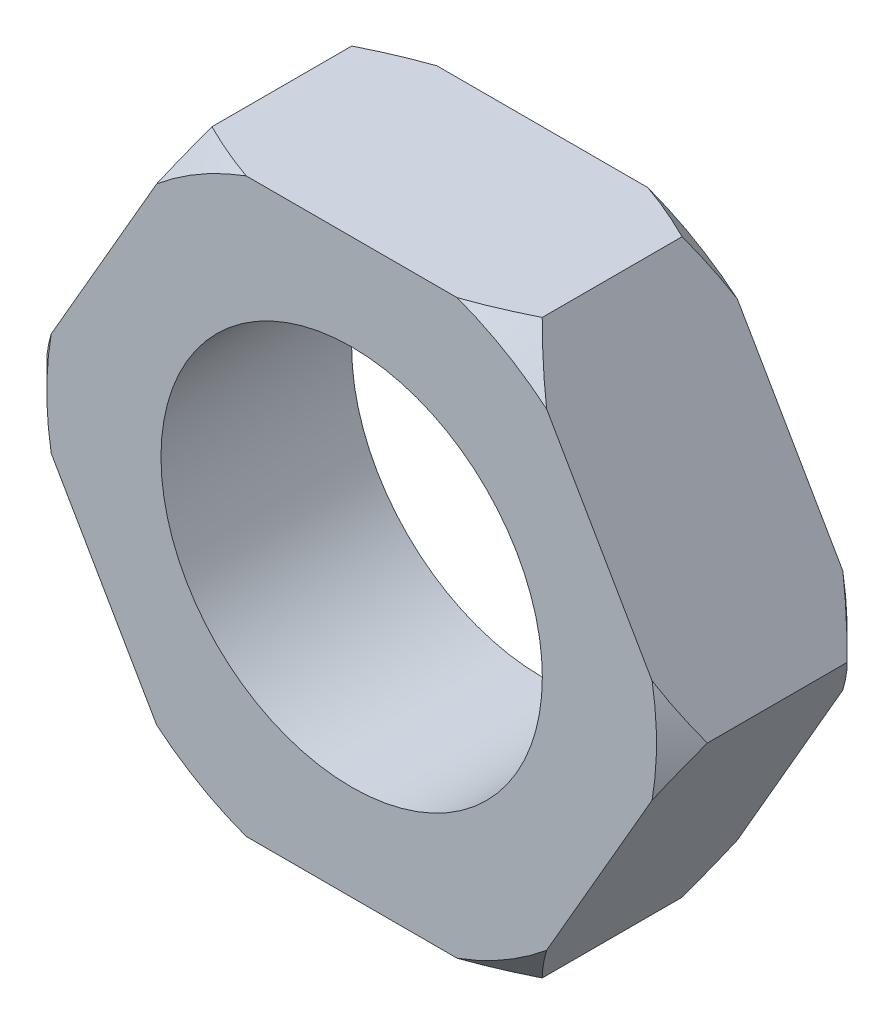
ISO-10303-21;
HEADER;
FILE_DESCRIPTION(('STEP AP214'),'2;1');
FILE_NAME('part.step','',(''),(''),'','','');
FILE_SCHEMA(('AUTOMOTIVE_DESIGN { 1 0 10303 214 1 1 1 1 }'));
ENDSEC;
DATA;
#1=APPLICATION_CONTEXT('core data for automotive mechanical design processes');
#2=APPLICATION_PROTOCOL_DEFINITION('international standard','automotive_design',2000,#1);
#3=PRODUCT_CONTEXT('',#1,'mechanical');
#4=PRODUCT('Part','Part','',(#3));
#5=PRODUCT_RELATED_PRODUCT_CATEGORY('part','',(#4));
#6=PRODUCT_DEFINITION_FORMATION('','',#4);
#7=PRODUCT_DEFINITION_CONTEXT('part definition',#1,'design');
#8=PRODUCT_DEFINITION('design','',#6,#7);
#9=PRODUCT_DEFINITION_SHAPE('','',#8);
#10=(LENGTH_UNIT() NAMED_UNIT(*) SI_UNIT(.MILLI.,.METRE.));
#11=(NAMED_UNIT(*) PLANE_ANGLE_UNIT() SI_UNIT($,.RADIAN.));
#12=(NAMED_UNIT(*) SI_UNIT($,.STERADIAN.) SOLID_ANGLE_UNIT());
#13=UNCERTAINTY_MEASURE_WITH_UNIT(LENGTH_MEASURE(1.E-05),#10,'distance_accuracy_value','');
#14=(GEOMETRIC_REPRESENTATION_CONTEXT(3) GLOBAL_UNCERTAINTY_ASSIGNED_CONTEXT((#13)) GLOBAL_UNIT_ASSIGNED_CONTEXT((#10,
#11,#12)) REPRESENTATION_CONTEXT('',''));
#15=CARTESIAN_POINT('',(0.,0.,0.));
#16=DIRECTION('',(0.,0.,1.));
#17=DIRECTION('',(1.,0.,0.));
#18=AXIS2_PLACEMENT_3D('',#15,#16,#17);
#19=CARTESIAN_POINT('',(2.59807621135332,4.5,-3.));
#20=DIRECTION('',(0.,1.,0.));
#21=DIRECTION('',(-1.,0.,0.));
#22=AXIS2_PLACEMENT_3D('',#19,#20,#21);
#23=PLANE('',#22);
#24=CARTESIAN_POINT('',(5.72519162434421,4.5,-2.48586784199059));
#25=CARTESIAN_POINT('',(5.5964788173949,4.5,-2.38469076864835));
#26=CARTESIAN_POINT('',(5.46714496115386,4.5,-2.28429355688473));
#27=CARTESIAN_POINT('',(5.20699469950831,4.5,-2.08539491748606));
#28=CARTESIAN_POINT('',(5.0761780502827,4.5,-1.98689380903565));
#29=CARTESIAN_POINT('',(4.81218699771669,4.5,-1.79165633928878));
#30=CARTESIAN_POINT('',(4.67900392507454,4.5,-1.69493166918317));
#31=CARTESIAN_POINT('',(4.41067339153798,4.5,-1.50425416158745));
#32=CARTESIAN_POINT('',(4.27552602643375,4.5,-1.41030118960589));
#33=CARTESIAN_POINT('',(3.99612275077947,4.5,-1.22114738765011));
#34=CARTESIAN_POINT('',(3.85174942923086,4.5,-1.12611932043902));
#35=CARTESIAN_POINT('',(3.56006385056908,4.5,-0.940691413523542));
#36=CARTESIAN_POINT('',(3.41275184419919,4.5,-0.850291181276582));
#37=CARTESIAN_POINT('',(3.1149849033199,4.5,-0.675467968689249));
#38=CARTESIAN_POINT('',(2.96453657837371,4.5,-0.591033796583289));
#39=CARTESIAN_POINT('',(2.65976117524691,4.5,-0.429517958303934));
#40=CARTESIAN_POINT('',(2.50543518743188,4.5,-0.352434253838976));
#41=CARTESIAN_POINT('',(2.20882797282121,4.5,-0.215185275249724));
#42=CARTESIAN_POINT('',(2.06697863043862,4.5,-0.154093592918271));
#43=CARTESIAN_POINT('',(1.77958966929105,4.5,-0.0411491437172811));
#44=CARTESIAN_POINT('',(1.63404969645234,4.5,0.0107027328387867));
#45=CARTESIAN_POINT('',(1.34108520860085,4.5,0.102602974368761));
#46=CARTESIAN_POINT('',(1.19370181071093,4.5,0.142780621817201));
#47=CARTESIAN_POINT('',(0.896000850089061,4.5,0.210105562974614));
#48=CARTESIAN_POINT('',(0.745684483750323,4.5,0.237258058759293));
#49=CARTESIAN_POINT('',(0.440288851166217,4.5,0.277242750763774));
#50=CARTESIAN_POINT('',(0.285172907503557,4.5,0.289800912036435));
#51=CARTESIAN_POINT('',(-0.0255213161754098,4.5,0.298759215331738));
#52=CARTESIAN_POINT('',(-0.181099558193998,4.5,0.295160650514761));
#53=CARTESIAN_POINT('',(-0.491545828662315,4.5,0.272043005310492));
#54=CARTESIAN_POINT('',(-0.646409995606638,4.5,0.252473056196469));
#55=CARTESIAN_POINT('',(-0.953565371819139,4.5,0.198720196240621));
#56=CARTESIAN_POINT('',(-1.10585588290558,4.5,0.164533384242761));
#57=CARTESIAN_POINT('',(-1.45510119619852,4.5,0.0706165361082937));
#58=CARTESIAN_POINT('',(-1.65078997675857,4.5,0.00621591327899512));
#59=CARTESIAN_POINT('',(-2.0356643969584,4.5,-0.139647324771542));
#60=CARTESIAN_POINT('',(-2.22484596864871,4.5,-0.22112039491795));
#61=CARTESIAN_POINT('',(-2.59838425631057,4.5,-0.397527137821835));
#62=CARTESIAN_POINT('',(-2.78269723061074,4.5,-0.492552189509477));
#63=CARTESIAN_POINT('',(-3.14585404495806,4.5,-0.692328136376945));
#64=CARTESIAN_POINT('',(-3.32469918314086,4.5,-0.797076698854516));
#65=CARTESIAN_POINT('',(-3.69722583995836,4.5,-1.02583615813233));
#66=CARTESIAN_POINT('',(-3.89038049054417,4.5,-1.15069924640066));
#67=CARTESIAN_POINT('',(-4.27216641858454,4.5,-1.40718817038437));
#68=CARTESIAN_POINT('',(-4.46079679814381,4.5,-1.53881533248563));
#69=CARTESIAN_POINT('',(-4.83036194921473,4.5,-1.80432038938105));
#70=CARTESIAN_POINT('',(-5.01137501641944,4.5,-1.93808973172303));
#71=CARTESIAN_POINT('',(-5.28066122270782,4.5,-2.14156645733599));
#72=CARTESIAN_POINT('',(-5.37002353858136,4.5,-2.20984075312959));
#73=CARTESIAN_POINT('',(-5.54808641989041,4.5,-2.34724043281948));
#74=CARTESIAN_POINT('',(-5.6367870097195,4.5,-2.41636578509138));
#75=CARTESIAN_POINT('',(-5.72519162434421,4.5,-2.48586784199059));
#76=B_SPLINE_CURVE_WITH_KNOTS('',3,(#24,#25,#26,#27,#28,#29,#30,#31,#32,#33,#34,#35,#36,#37,#38,
#39,#40,#41,#42,#43,#44,#45,#46,#47,#48,#49,#50,#51,#52,#53,#54,#55,#56,#57,#58,#59,#60,#61,#62,
#63,#64,#65,#66,#67,#68,#69,#70,#71,#72,#73,#74,#75),.UNSPECIFIED.,.F.,.F.,(4,2,2,2,2,2,2,2,2,2,
2,2,2,2,2,2,2,2,2,2,2,2,2,2,2,4),(0.,0.491162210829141,0.98240639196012,1.47617875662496,
1.96992712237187,2.48837945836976,3.00678774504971,3.52419620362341,4.04146076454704,
4.50453621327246,4.96765625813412,5.4254329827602,5.88302672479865,6.34908047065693,
6.81509691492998,7.28260343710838,7.75023481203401,8.36718918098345,8.98452247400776,
9.60623460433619,10.2277979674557,10.9176023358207,11.6075424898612,12.2827085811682,
12.6200812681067,12.9574414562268),.UNSPECIFIED.);
#77=CARTESIAN_POINT('',(2.59807621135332,4.5,-0.399999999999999));
#78=VERTEX_POINT('',#77);
#79=CARTESIAN_POINT('',(1.65924020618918,4.5,0.));
#80=VERTEX_POINT('',#79);
#81=EDGE_CURVE('E324',#78,#80,#76,.T.);
#82=ORIENTED_EDGE('',*,*,#81,.F.);
#83=DIRECTION('',(0.,0.,1.));
#84=VECTOR('',#83,1.);
#85=CARTESIAN_POINT('',(2.59807621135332,4.5,-3.));
#86=LINE('',#85,#84);
#87=CARTESIAN_POINT('',(2.59807621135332,4.5,-2.6));
#88=VERTEX_POINT('',#87);
#89=EDGE_CURVE('E196',#88,#78,#86,.T.);
#90=ORIENTED_EDGE('',*,*,#89,.F.);
#91=CARTESIAN_POINT('',(-5.72519162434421,4.5,-0.514132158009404));
#92=CARTESIAN_POINT('',(-5.5964788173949,4.5,-0.615309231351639));
#93=CARTESIAN_POINT('',(-5.46714496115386,4.5,-0.715706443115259));
#94=CARTESIAN_POINT('',(-5.20699469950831,4.5,-0.914605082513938));
#95=CARTESIAN_POINT('',(-5.0761780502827,4.5,-1.01310619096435));
#96=CARTESIAN_POINT('',(-4.8121869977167,4.5,-1.20834366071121));
#97=CARTESIAN_POINT('',(-4.67900392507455,4.5,-1.30506833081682));
#98=CARTESIAN_POINT('',(-4.41067339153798,4.5,-1.49574583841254));
#99=CARTESIAN_POINT('',(-4.27552602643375,4.5,-1.5896988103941));
#100=CARTESIAN_POINT('',(-3.99612275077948,4.5,-1.77885261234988));
#101=CARTESIAN_POINT('',(-3.85174942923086,4.5,-1.87388067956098));
#102=CARTESIAN_POINT('',(-3.56006385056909,4.5,-2.05930858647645));
#103=CARTESIAN_POINT('',(-3.4127518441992,4.5,-2.14970881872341));
#104=CARTESIAN_POINT('',(-3.11498490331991,4.5,-2.32453203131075));
#105=CARTESIAN_POINT('',(-2.96453657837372,4.5,-2.40896620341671));
#106=CARTESIAN_POINT('',(-2.65976117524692,4.5,-2.57048204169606));
#107=CARTESIAN_POINT('',(-2.50543518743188,4.5,-2.64756574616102));
#108=CARTESIAN_POINT('',(-2.20882797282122,4.5,-2.78481472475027));
#109=CARTESIAN_POINT('',(-2.06697863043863,4.5,-2.84590640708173));
#110=CARTESIAN_POINT('',(-1.77958966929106,4.5,-2.95885085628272));
#111=CARTESIAN_POINT('',(-1.63404969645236,4.5,-3.01070273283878));
#112=CARTESIAN_POINT('',(-1.34108520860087,4.5,-3.10260297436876));
#113=CARTESIAN_POINT('',(-1.19370181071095,4.5,-3.1427806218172));
#114=CARTESIAN_POINT('',(-0.896000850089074,4.5,-3.21010556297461));
#115=CARTESIAN_POINT('',(-0.745684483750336,4.5,-3.23725805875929));
#116=CARTESIAN_POINT('',(-0.440288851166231,4.5,-3.27724275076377));
#117=CARTESIAN_POINT('',(-0.285172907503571,4.5,-3.28980091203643));
#118=CARTESIAN_POINT('',(0.0255213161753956,4.5,-3.29875921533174));
#119=CARTESIAN_POINT('',(0.181099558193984,4.5,-3.29516065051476));
#120=CARTESIAN_POINT('',(0.4915458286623,4.5,-3.27204300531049));
#121=CARTESIAN_POINT('',(0.646409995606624,4.5,-3.25247305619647));
#122=CARTESIAN_POINT('',(0.953565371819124,4.5,-3.19872019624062));
#123=CARTESIAN_POINT('',(1.10585588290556,4.5,-3.16453338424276));
#124=CARTESIAN_POINT('',(1.45510119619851,4.5,-3.0706165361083));
#125=CARTESIAN_POINT('',(1.65078997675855,4.5,-3.006215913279));
#126=CARTESIAN_POINT('',(2.03566439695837,4.5,-2.86035267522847));
#127=CARTESIAN_POINT('',(2.22484596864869,4.5,-2.77887960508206));
#128=CARTESIAN_POINT('',(2.59838425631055,4.5,-2.60247286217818));
#129=CARTESIAN_POINT('',(2.78269723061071,4.5,-2.50744781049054));
#130=CARTESIAN_POINT('',(3.14585404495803,4.5,-2.30767186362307));
#131=CARTESIAN_POINT('',(3.32469918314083,4.5,-2.2029233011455));
#132=CARTESIAN_POINT('',(3.69722583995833,4.5,-1.97416384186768));
#133=CARTESIAN_POINT('',(3.89038049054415,4.5,-1.84930075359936));
#134=CARTESIAN_POINT('',(4.27216641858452,4.5,-1.59281182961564));
#135=CARTESIAN_POINT('',(4.46079679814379,4.5,-1.46118466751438));
#136=CARTESIAN_POINT('',(4.83036194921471,4.5,-1.19567961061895));
#137=CARTESIAN_POINT('',(5.01137501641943,4.5,-1.06191026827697));
#138=CARTESIAN_POINT('',(5.28066122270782,4.5,-0.858433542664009));
#139=CARTESIAN_POINT('',(5.37002353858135,4.5,-0.790159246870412));
#140=CARTESIAN_POINT('',(5.54808641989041,4.5,-0.652759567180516));
#141=CARTESIAN_POINT('',(5.6367870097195,4.5,-0.58363421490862));
#142=CARTESIAN_POINT('',(5.72519162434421,4.5,-0.514132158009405));
#143=B_SPLINE_CURVE_WITH_KNOTS('',3,(#91,#92,#93,#94,#95,#96,#97,#98,#99,#100,#101,#102,#103,
#104,#105,#106,#107,#108,#109,#110,#111,#112,#113,#114,#115,#116,#117,#118,#119,#120,#121,#122,
#123,#124,#125,#126,#127,#128,#129,#130,#131,#132,#133,#134,#135,#136,#137,#138,#139,#140,#141,
#142),.UNSPECIFIED.,.F.,.F.,(4,2,2,2,2,2,2,2,2,2,2,2,2,2,2,2,2,2,2,2,2,2,2,2,2,4),(0.,
0.49116221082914,0.982406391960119,1.47617875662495,1.96992712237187,2.48837945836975,
3.00678774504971,3.5241962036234,4.04146076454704,4.50453621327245,4.96765625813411,
5.42543298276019,5.88302672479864,6.34908047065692,6.81509691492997,7.28260343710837,
7.750234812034,8.36718918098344,8.98452247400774,9.60623460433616,10.2277979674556,
10.9176023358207,11.6075424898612,12.2827085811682,12.6200812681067,12.9574414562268),.UNSPECIFIED.);
#144=CARTESIAN_POINT('',(1.65924020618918,4.5,-3.));
#145=VERTEX_POINT('',#144);
#146=EDGE_CURVE('E220',#145,#88,#143,.T.);
#147=ORIENTED_EDGE('',*,*,#146,.F.);
#148=DIRECTION('',(-1.,0.,0.));
#149=VECTOR('',#148,1.);
#150=CARTESIAN_POINT('',(2.59807621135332,4.5,-3.));
#151=LINE('',#150,#149);
#152=CARTESIAN_POINT('',(-1.65924020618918,4.5,-3.));
#153=VERTEX_POINT('',#152);
#154=EDGE_CURVE('E232',#145,#153,#151,.T.);
#155=ORIENTED_EDGE('',*,*,#154,.T.);
#156=CARTESIAN_POINT('',(-2.59807621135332,4.5,-2.6));
#157=VERTEX_POINT('',#156);
#158=EDGE_CURVE('E235',#157,#153,#143,.T.);
#159=ORIENTED_EDGE('',*,*,#158,.F.);
#160=DIRECTION('',(0.,0.,1.));
#161=VECTOR('',#160,1.);
#162=CARTESIAN_POINT('',(-2.59807621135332,4.5,-3.));
#163=LINE('',#162,#161);
#164=CARTESIAN_POINT('',(-2.59807621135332,4.5,-0.399999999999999));
#165=VERTEX_POINT('',#164);
#166=EDGE_CURVE('E185',#157,#165,#163,.T.);
#167=ORIENTED_EDGE('',*,*,#166,.T.);
#168=CARTESIAN_POINT('',(-1.65924020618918,4.5,0.));
#169=VERTEX_POINT('',#168);
#170=EDGE_CURVE('E320',#169,#165,#76,.T.);
#171=ORIENTED_EDGE('',*,*,#170,.F.);
#172=DIRECTION('',(-1.,0.,0.));
#173=VECTOR('',#172,1.);
#174=CARTESIAN_POINT('',(2.59807621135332,4.5,0.));
#175=LINE('',#174,#173);
#176=EDGE_CURVE('E337',#80,#169,#175,.T.);
#177=ORIENTED_EDGE('',*,*,#176,.F.);
#178=EDGE_LOOP('',(#82,#90,#147,#155,#159,#167,#171,#177));
#179=FACE_BOUND('',#178,.T.);
#180=ADVANCED_FACE('F32',(#179),#23,.T.);
#181=CARTESIAN_POINT('',(5.19615242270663,0.,-3.));
#182=DIRECTION('',(0.866025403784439,0.5,0.));
#183=DIRECTION('',(-0.5,0.866025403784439,0.));
#184=AXIS2_PLACEMENT_3D('',#181,#182,#183);
#185=PLANE('',#184);
#186=CARTESIAN_POINT('',(7.00159334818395,-3.12711541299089,-2.87203903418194));
#187=CARTESIAN_POINT('',(6.93988701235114,-3.02023690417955,-2.77212334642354));
#188=CARTESIAN_POINT('',(6.87793407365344,-2.91293126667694,-2.67281125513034));
#189=CARTESIAN_POINT('',(6.75344914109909,-2.69731703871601,-2.47562656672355));
#190=CARTESIAN_POINT('',(6.69091709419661,-2.58900835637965,-2.37775410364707));
#191=CARTESIAN_POINT('',(6.56504596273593,-2.37099316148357,-2.18346257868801));
#192=CARTESIAN_POINT('',(6.5017052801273,-2.26128388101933,-2.08704765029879));
#193=CARTESIAN_POINT('',(6.37427004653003,-2.04055958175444,-1.89623580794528));
#194=CARTESIAN_POINT('',(6.31017551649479,-1.92954459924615,-1.80183883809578));
#195=CARTESIAN_POINT('',(6.17930210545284,-1.70286520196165,-1.61283312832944));
#196=CARTESIAN_POINT('',(6.1124984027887,-1.58715779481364,-1.51829296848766));
#197=CARTESIAN_POINT('',(5.97782541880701,-1.35389734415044,-1.33230118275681));
#198=CARTESIAN_POINT('',(5.90995617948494,-1.23634437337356,-1.24084943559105));
#199=CARTESIAN_POINT('',(5.77303811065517,-0.999195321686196,-1.06180235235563));
#200=CARTESIAN_POINT('',(5.70399036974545,-0.879601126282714,-0.974203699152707));
#201=CARTESIAN_POINT('',(5.56447228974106,-0.637948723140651,-0.803680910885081));
#202=CARTESIAN_POINT('',(5.49400213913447,-0.515890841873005,-0.720756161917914));
#203=CARTESIAN_POINT('',(5.35022877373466,-0.266868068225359,-0.559383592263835));
#204=CARTESIAN_POINT('',(5.27689789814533,-0.139855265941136,-0.48103369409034));
#205=CARTESIAN_POINT('',(5.12830915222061,0.11750799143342,-0.331892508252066));
#206=CARTESIAN_POINT('',(5.05305101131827,0.247858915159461,-0.261102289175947));
#207=CARTESIAN_POINT('',(4.90086868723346,0.511446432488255,-0.129431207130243));
#208=CARTESIAN_POINT('',(4.82395596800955,0.644663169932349,-0.0684978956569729));
#209=CARTESIAN_POINT('',(4.66803687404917,0.914722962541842,0.0415713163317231));
#210=CARTESIAN_POINT('',(4.5890311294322,1.05156492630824,0.0907107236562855));
#211=CARTESIAN_POINT('',(4.4444571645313,1.30197437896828,0.166596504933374));
#212=CARTESIAN_POINT('',(4.37921717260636,1.41497335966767,0.195829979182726));
#213=CARTESIAN_POINT('',(4.24776409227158,1.64265677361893,0.243666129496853));
#214=CARTESIAN_POINT('',(4.18155114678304,1.75734095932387,0.262270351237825));
#215=CARTESIAN_POINT('',(4.04867146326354,1.98749532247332,0.287890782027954));
#216=CARTESIAN_POINT('',(3.98200567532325,2.10296385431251,0.294926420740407));
#217=CARTESIAN_POINT('',(3.84862399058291,2.33398770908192,0.297083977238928));
#218=CARTESIAN_POINT('',(3.78190809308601,2.4495430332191,0.292205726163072));
#219=CARTESIAN_POINT('',(3.64914593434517,2.67949383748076,0.270836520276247));
#220=CARTESIAN_POINT('',(3.58309828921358,2.79389171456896,0.254379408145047));
#221=CARTESIAN_POINT('',(3.45189304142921,3.02114586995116,0.210726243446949));
#222=CARTESIAN_POINT('',(3.38673565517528,3.13400177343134,0.18352762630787));
#223=CARTESIAN_POINT('',(3.25742661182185,3.35797160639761,0.119503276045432));
#224=CARTESIAN_POINT('',(3.19327844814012,3.46907948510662,0.0826496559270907));
#225=CARTESIAN_POINT('',(3.06633160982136,3.68895785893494,0.000700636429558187));
#226=CARTESIAN_POINT('',(3.00353286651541,3.79772847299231,-0.0443943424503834));
#227=CARTESIAN_POINT('',(2.8562344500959,4.05285681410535,-0.159562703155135));
#228=CARTESIAN_POINT('',(2.77233464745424,4.1981755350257,-0.232693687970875));
#229=CARTESIAN_POINT('',(2.60692263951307,4.48467753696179,-0.389126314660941));
#230=CARTESIAN_POINT('',(2.52541174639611,4.6258585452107,-0.472433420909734));
#231=CARTESIAN_POINT('',(2.36436854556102,4.90479355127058,-0.647090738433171));
#232=CARTESIAN_POINT('',(2.28484075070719,5.04253973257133,-0.738457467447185));
#233=CARTESIAN_POINT('',(2.12765784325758,5.31478851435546,-0.927318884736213));
#234=CARTESIAN_POINT('',(2.05000239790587,5.449291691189,-1.02481247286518));
#235=CARTESIAN_POINT('',(1.89592550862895,5.71616069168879,-1.22508153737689));
#236=CARTESIAN_POINT('',(1.81951115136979,5.84851424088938,-1.32787871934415));
#237=CARTESIAN_POINT('',(1.6680266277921,6.1108931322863,-1.53735810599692));
#238=CARTESIAN_POINT('',(1.5929565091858,6.24091839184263,-1.64404044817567));
#239=CARTESIAN_POINT('',(1.44403551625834,6.4988571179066,-1.86041768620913));
#240=CARTESIAN_POINT('',(1.37018342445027,6.62677269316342,-1.97010924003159));
#241=CARTESIAN_POINT('',(1.22344290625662,6.88093472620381,-2.19204182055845));
#242=CARTESIAN_POINT('',(1.15055449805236,7.00718115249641,-2.30428289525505));
#243=CARTESIAN_POINT('',(1.03007467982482,7.21585831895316,-2.49261166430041));
#244=CARTESIAN_POINT('',(0.982252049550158,7.29868954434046,-2.56810941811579));
#245=CARTESIAN_POINT('',(0.887117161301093,7.46346800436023,-2.719634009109));
#246=CARTESIAN_POINT('',(0.839803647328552,7.54541741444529,-2.79565769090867));
#247=CARTESIAN_POINT('',(0.792635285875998,7.62711541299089,-2.87203903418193));
#248=B_SPLINE_CURVE_WITH_KNOTS('',3,(#186,#187,#188,#189,#190,#191,#192,#193,#194,#195,#196,
#197,#198,#199,#200,#201,#202,#203,#204,#205,#206,#207,#208,#209,#210,#211,#212,#213,#214,#215,
#216,#217,#218,#219,#220,#221,#222,#223,#224,#225,#226,#227,#228,#229,#230,#231,#232,#233,#234,
#235,#236,#237,#238,#239,#240,#241,#242,#243,#244,#245,#246,#247),.UNSPECIFIED.,.F.,.F.,(4,2,2,
2,2,2,2,2,2,2,2,2,2,2,2,2,2,2,2,2,2,2,2,2,2,2,2,2,2,2,4),(0.,0.476369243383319,0.95278256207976,
1.43035943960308,1.90792307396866,2.39890568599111,2.88986899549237,3.38040101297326,
3.87086844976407,4.36952878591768,4.8682595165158,5.36424239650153,5.86007761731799,
6.26083686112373,6.66153781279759,7.06156508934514,7.46159803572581,7.8604665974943,
8.25943044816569,8.65955959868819,9.05966833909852,9.60833359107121,10.1572947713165,
10.7074083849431,11.2574235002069,11.8099026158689,12.3624013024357,12.9143094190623,
13.4662279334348,13.8317799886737,14.1959248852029),.UNSPECIFIED.);
#249=CARTESIAN_POINT('',(5.19615242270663,0.,-0.399999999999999));
#250=VERTEX_POINT('',#249);
#251=CARTESIAN_POINT('',(4.72673442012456,0.813055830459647,0.));
#252=VERTEX_POINT('',#251);
#253=EDGE_CURVE('E48',#250,#252,#248,.T.);
#254=ORIENTED_EDGE('',*,*,#253,.F.);
#255=DIRECTION('',(0.,0.,1.));
#256=VECTOR('',#255,1.);
#257=CARTESIAN_POINT('',(5.19615242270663,0.,-3.));
#258=LINE('',#257,#256);
#259=CARTESIAN_POINT('',(5.19615242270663,0.,-2.6));
#260=VERTEX_POINT('',#259);
#261=EDGE_CURVE('E202',#260,#250,#258,.T.);
#262=ORIENTED_EDGE('',*,*,#261,.F.);
#263=CARTESIAN_POINT('',(0.792635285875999,7.62711541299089,-0.127960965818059));
#264=CARTESIAN_POINT('',(0.85434162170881,7.52023690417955,-0.227876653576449));
#265=CARTESIAN_POINT('',(0.916294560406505,7.41293126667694,-0.327188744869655));
#266=CARTESIAN_POINT('',(1.04077949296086,7.19731703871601,-0.52437343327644));
#267=CARTESIAN_POINT('',(1.10331153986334,7.08900835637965,-0.622245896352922));
#268=CARTESIAN_POINT('',(1.22918267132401,6.87099316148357,-0.81653742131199));
#269=CARTESIAN_POINT('',(1.29252335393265,6.76128388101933,-0.912952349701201));
#270=CARTESIAN_POINT('',(1.41995858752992,6.54055958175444,-1.10376419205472));
#271=CARTESIAN_POINT('',(1.48405311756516,6.42954459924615,-1.19816116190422));
#272=CARTESIAN_POINT('',(1.61492652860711,6.20286520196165,-1.38716687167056));
#273=CARTESIAN_POINT('',(1.68173023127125,6.08715779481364,-1.48170703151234));
#274=CARTESIAN_POINT('',(1.81640321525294,5.85389734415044,-1.66769881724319));
#275=CARTESIAN_POINT('',(1.88427245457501,5.73634437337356,-1.75915056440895));
#276=CARTESIAN_POINT('',(2.02119052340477,5.4991953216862,-1.93819764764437));
#277=CARTESIAN_POINT('',(2.09023826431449,5.37960112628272,-2.02579630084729));
#278=CARTESIAN_POINT('',(2.22975634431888,5.13794872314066,-2.19631908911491));
#279=CARTESIAN_POINT('',(2.30022649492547,5.01589084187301,-2.27924383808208));
#280=CARTESIAN_POINT('',(2.44399986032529,4.76686806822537,-2.44061640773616));
#281=CARTESIAN_POINT('',(2.51733073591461,4.63985526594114,-2.51896630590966));
#282=CARTESIAN_POINT('',(2.66591948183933,4.38249200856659,-2.66810749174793));
#283=CARTESIAN_POINT('',(2.74117762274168,4.25214108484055,-2.73889771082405));
#284=CARTESIAN_POINT('',(2.89335994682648,3.98855356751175,-2.87056879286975));
#285=CARTESIAN_POINT('',(2.97027266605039,3.85533683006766,-2.93150210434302));
#286=CARTESIAN_POINT('',(3.12619176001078,3.58527703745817,-3.04157131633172));
#287=CARTESIAN_POINT('',(3.20519750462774,3.44843507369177,-3.09071072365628));
#288=CARTESIAN_POINT('',(3.34977146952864,3.19802562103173,-3.16659650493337));
#289=CARTESIAN_POINT('',(3.41501146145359,3.08502664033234,-3.19582997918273));
#290=CARTESIAN_POINT('',(3.54646454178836,2.85734322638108,-3.24366612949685));
#291=CARTESIAN_POINT('',(3.6126774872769,2.74265904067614,-3.26227035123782));
#292=CARTESIAN_POINT('',(3.7455571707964,2.51250467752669,-3.28789078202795));
#293=CARTESIAN_POINT('',(3.81222295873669,2.3970361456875,-3.29492642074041));
#294=CARTESIAN_POINT('',(3.94560464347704,2.16601229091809,-3.29708397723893));
#295=CARTESIAN_POINT('',(4.01232054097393,2.05045696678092,-3.29220572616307));
#296=CARTESIAN_POINT('',(4.14508269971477,1.82050616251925,-3.27083652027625));
#297=CARTESIAN_POINT('',(4.21113034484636,1.70610828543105,-3.25437940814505));
#298=CARTESIAN_POINT('',(4.34233559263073,1.47885413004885,-3.21072624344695));
#299=CARTESIAN_POINT('',(4.40749297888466,1.36599822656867,-3.18352762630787));
#300=CARTESIAN_POINT('',(4.53680202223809,1.1420283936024,-3.11950327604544));
#301=CARTESIAN_POINT('',(4.60095018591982,1.0309205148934,-3.0826496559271));
#302=CARTESIAN_POINT('',(4.72789702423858,0.811042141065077,-3.00070063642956));
#303=CARTESIAN_POINT('',(4.79069576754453,0.702271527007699,-2.95560565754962));
#304=CARTESIAN_POINT('',(4.93799418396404,0.447143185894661,-2.84043729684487));
#305=CARTESIAN_POINT('',(5.02189398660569,0.301824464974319,-2.76730631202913));
#306=CARTESIAN_POINT('',(5.18730599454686,0.0153224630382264,-2.61087368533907));
#307=CARTESIAN_POINT('',(5.26881688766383,-0.125858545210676,-2.52756657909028));
#308=CARTESIAN_POINT('',(5.42986008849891,-0.404793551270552,-2.35290926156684));
#309=CARTESIAN_POINT('',(5.50938788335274,-0.542539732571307,-2.26154253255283));
#310=CARTESIAN_POINT('',(5.66657079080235,-0.814788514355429,-2.07268111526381));
#311=CARTESIAN_POINT('',(5.74422623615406,-0.949291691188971,-1.97518752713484));
#312=CARTESIAN_POINT('',(5.89830312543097,-1.21616069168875,-1.77491846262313));
#313=CARTESIAN_POINT('',(5.97471748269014,-1.34851424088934,-1.67212128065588));
#314=CARTESIAN_POINT('',(6.12620200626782,-1.61089313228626,-1.46264189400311));
#315=CARTESIAN_POINT('',(6.20127212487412,-1.74091839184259,-1.35595955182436));
#316=CARTESIAN_POINT('',(6.35019311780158,-1.99885711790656,-1.1395823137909));
#317=CARTESIAN_POINT('',(6.42404520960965,-2.12677269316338,-1.02989075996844));
#318=CARTESIAN_POINT('',(6.5707857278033,-2.38093472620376,-0.807958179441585));
#319=CARTESIAN_POINT('',(6.64367413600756,-2.50718115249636,-0.695717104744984));
#320=CARTESIAN_POINT('',(6.7641539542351,-2.71585831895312,-0.507388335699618));
#321=CARTESIAN_POINT('',(6.81197658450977,-2.79868954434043,-0.431890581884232));
#322=CARTESIAN_POINT('',(6.90711147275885,-2.96346800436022,-0.280365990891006));
#323=CARTESIAN_POINT('',(6.95442498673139,-3.04541741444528,-0.204342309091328));
#324=CARTESIAN_POINT('',(7.00159334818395,-3.12711541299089,-0.127960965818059));
#325=B_SPLINE_CURVE_WITH_KNOTS('',3,(#263,#264,#265,#266,#267,#268,#269,#270,#271,#272,#273,
#274,#275,#276,#277,#278,#279,#280,#281,#282,#283,#284,#285,#286,#287,#288,#289,#290,#291,#292,
#293,#294,#295,#296,#297,#298,#299,#300,#301,#302,#303,#304,#305,#306,#307,#308,#309,#310,#311,
#312,#313,#314,#315,#316,#317,#318,#319,#320,#321,#322,#323,#324),.UNSPECIFIED.,.F.,.F.,(4,2,2,
2,2,2,2,2,2,2,2,2,2,2,2,2,2,2,2,2,2,2,2,2,2,2,2,2,2,2,4),(0.,0.47636924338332,0.95278256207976,
1.43035943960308,1.90792307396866,2.39890568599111,2.88986899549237,3.38040101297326,
3.87086844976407,4.36952878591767,4.86825951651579,5.36424239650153,5.86007761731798,
6.26083686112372,6.66153781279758,7.06156508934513,7.4615980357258,7.86046659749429,
8.25943044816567,8.65955959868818,9.0596683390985,9.60833359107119,10.1572947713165,
10.707408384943,11.2574235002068,11.8099026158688,12.3624013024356,12.9143094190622,
13.4662279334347,13.8317799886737,14.1959248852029),.UNSPECIFIED.);
#326=CARTESIAN_POINT('',(4.72673442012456,0.813055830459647,-3.));
#327=VERTEX_POINT('',#326);
#328=EDGE_CURVE('E339',#327,#260,#325,.T.);
#329=ORIENTED_EDGE('',*,*,#328,.F.);
#330=DIRECTION('',(-0.5,0.866025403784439,0.));
#331=VECTOR('',#330,1.);
#332=CARTESIAN_POINT('',(5.19615242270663,0.,-3.));
#333=LINE('',#332,#331);
#334=CARTESIAN_POINT('',(3.06749421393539,3.68694416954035,-3.));
#335=VERTEX_POINT('',#334);
#336=EDGE_CURVE('E191',#327,#335,#333,.T.);
#337=ORIENTED_EDGE('',*,*,#336,.T.);
#338=EDGE_CURVE('E222',#88,#335,#325,.T.);
#339=ORIENTED_EDGE('',*,*,#338,.F.);
#340=ORIENTED_EDGE('',*,*,#89,.T.);
#341=CARTESIAN_POINT('',(3.06749421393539,3.68694416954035,0.));
#342=VERTEX_POINT('',#341);
#343=EDGE_CURVE('E328',#342,#78,#248,.T.);
#344=ORIENTED_EDGE('',*,*,#343,.F.);
#345=DIRECTION('',(-0.5,0.866025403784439,0.));
#346=VECTOR('',#345,1.);
#347=CARTESIAN_POINT('',(5.19615242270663,0.,0.));
#348=LINE('',#347,#346);
#349=EDGE_CURVE('E241',#252,#342,#348,.T.);
#350=ORIENTED_EDGE('',*,*,#349,.F.);
#351=EDGE_LOOP('',(#254,#262,#329,#337,#339,#340,#344,#350));
#352=FACE_BOUND('',#351,.T.);
#353=ADVANCED_FACE('F338',(#352),#185,.T.);
#354=CARTESIAN_POINT('',(2.59807621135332,-4.5,-3.));
#355=DIRECTION('',(0.866025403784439,-0.5,0.));
#356=DIRECTION('',(0.5,0.866025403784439,0.));
#357=AXIS2_PLACEMENT_3D('',#354,#355,#356);
#358=PLANE('',#357);
#359=CARTESIAN_POINT('',(0.792635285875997,-7.62711541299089,-2.87203903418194));
#360=CARTESIAN_POINT('',(0.854341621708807,-7.52023690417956,-2.77212334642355));
#361=CARTESIAN_POINT('',(0.916294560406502,-7.41293126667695,-2.67281125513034));
#362=CARTESIAN_POINT('',(1.04077949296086,-7.19731703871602,-2.47562656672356));
#363=CARTESIAN_POINT('',(1.10331153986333,-7.08900835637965,-2.37775410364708));
#364=CARTESIAN_POINT('',(1.22918267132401,-6.87099316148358,-2.18346257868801));
#365=CARTESIAN_POINT('',(1.29252335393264,-6.76128388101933,-2.0870476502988));
#366=CARTESIAN_POINT('',(1.41995858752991,-6.54055958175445,-1.89623580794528));
#367=CARTESIAN_POINT('',(1.48405311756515,-6.42954459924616,-1.80183883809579));
#368=CARTESIAN_POINT('',(1.6149265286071,-6.20286520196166,-1.61283312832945));
#369=CARTESIAN_POINT('',(1.68173023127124,-6.08715779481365,-1.51829296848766));
#370=CARTESIAN_POINT('',(1.81640321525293,-5.85389734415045,-1.33230118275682));
#371=CARTESIAN_POINT('',(1.884272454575,-5.73634437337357,-1.24084943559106));
#372=CARTESIAN_POINT('',(2.02119052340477,-5.49919532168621,-1.06180235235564));
#373=CARTESIAN_POINT('',(2.09023826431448,-5.37960112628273,-0.974203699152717));
#374=CARTESIAN_POINT('',(2.22975634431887,-5.13794872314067,-0.803680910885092));
#375=CARTESIAN_POINT('',(2.30022649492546,-5.01589084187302,-0.720756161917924));
#376=CARTESIAN_POINT('',(2.44399986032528,-4.76686806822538,-0.559383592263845));
#377=CARTESIAN_POINT('',(2.5173307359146,-4.63985526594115,-0.481033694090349));
#378=CARTESIAN_POINT('',(2.66591948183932,-4.3824920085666,-0.331892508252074));
#379=CARTESIAN_POINT('',(2.74117762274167,-4.25214108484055,-0.261102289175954));
#380=CARTESIAN_POINT('',(2.89335994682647,-3.98855356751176,-0.129431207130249));
#381=CARTESIAN_POINT('',(2.97027266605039,-3.85533683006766,-0.0684978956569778));
#382=CARTESIAN_POINT('',(3.12619176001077,-3.58527703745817,0.04157131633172));
#383=CARTESIAN_POINT('',(3.20519750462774,-3.44843507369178,0.0907107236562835));
#384=CARTESIAN_POINT('',(3.34977146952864,-3.19802562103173,0.166596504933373));
#385=CARTESIAN_POINT('',(3.41501146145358,-3.08502664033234,0.195829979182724));
#386=CARTESIAN_POINT('',(3.54646454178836,-2.85734322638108,0.243666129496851));
#387=CARTESIAN_POINT('',(3.6126774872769,-2.74265904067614,0.262270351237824));
#388=CARTESIAN_POINT('',(3.7455571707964,-2.51250467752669,0.287890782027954));
#389=CARTESIAN_POINT('',(3.81222295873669,-2.3970361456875,0.294926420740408));
#390=CARTESIAN_POINT('',(3.94560464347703,-2.16601229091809,0.297083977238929));
#391=CARTESIAN_POINT('',(4.01232054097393,-2.05045696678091,0.292205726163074));
#392=CARTESIAN_POINT('',(4.14508269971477,-1.82050616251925,0.270836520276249));
#393=CARTESIAN_POINT('',(4.21113034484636,-1.70610828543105,0.25437940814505));
#394=CARTESIAN_POINT('',(4.34233559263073,-1.47885413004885,0.210726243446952));
#395=CARTESIAN_POINT('',(4.40749297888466,-1.36599822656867,0.183527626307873));
#396=CARTESIAN_POINT('',(4.53680202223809,-1.1420283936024,0.119503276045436));
#397=CARTESIAN_POINT('',(4.60095018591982,-1.03092051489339,0.0826496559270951));
#398=CARTESIAN_POINT('',(4.72789702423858,-0.811042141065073,0.000700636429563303));
#399=CARTESIAN_POINT('',(4.79069576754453,-0.702271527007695,-0.0443943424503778));
#400=CARTESIAN_POINT('',(4.93799418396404,-0.447143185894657,-0.159562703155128));
#401=CARTESIAN_POINT('',(5.0218939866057,-0.301824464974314,-0.232693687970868));
#402=CARTESIAN_POINT('',(5.18730599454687,-0.0153224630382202,-0.389126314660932));
#403=CARTESIAN_POINT('',(5.26881688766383,0.125858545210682,-0.472433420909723));
#404=CARTESIAN_POINT('',(5.42986008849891,0.40479355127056,-0.647090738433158));
#405=CARTESIAN_POINT('',(5.50938788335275,0.542539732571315,-0.738457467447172));
#406=CARTESIAN_POINT('',(5.66657079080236,0.814788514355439,-0.927318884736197));
#407=CARTESIAN_POINT('',(5.74422623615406,0.949291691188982,-1.02481247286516));
#408=CARTESIAN_POINT('',(5.89830312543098,1.21616069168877,-1.22508153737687));
#409=CARTESIAN_POINT('',(5.97471748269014,1.34851424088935,-1.32787871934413));
#410=CARTESIAN_POINT('',(6.12620200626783,1.61089313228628,-1.5373581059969));
#411=CARTESIAN_POINT('',(6.20127212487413,1.74091839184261,-1.64404044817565));
#412=CARTESIAN_POINT('',(6.35019311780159,1.99885711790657,-1.86041768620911));
#413=CARTESIAN_POINT('',(6.42404520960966,2.12677269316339,-1.97010924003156));
#414=CARTESIAN_POINT('',(6.57078572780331,2.38093472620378,-2.19204182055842));
#415=CARTESIAN_POINT('',(6.64367413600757,2.50718115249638,-2.30428289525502));
#416=CARTESIAN_POINT('',(6.76415395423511,2.71585831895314,-2.49261166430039));
#417=CARTESIAN_POINT('',(6.81197658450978,2.79868954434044,-2.56810941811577));
#418=CARTESIAN_POINT('',(6.90711147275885,2.96346800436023,-2.71963400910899));
#419=CARTESIAN_POINT('',(6.95442498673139,3.04541741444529,-2.79565769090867));
#420=CARTESIAN_POINT('',(7.00159334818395,3.12711541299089,-2.87203903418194));
#421=B_SPLINE_CURVE_WITH_KNOTS('',3,(#359,#360,#361,#362,#363,#364,#365,#366,#367,#368,#369,
#370,#371,#372,#373,#374,#375,#376,#377,#378,#379,#380,#381,#382,#383,#384,#385,#386,#387,#388,
#389,#390,#391,#392,#393,#394,#395,#396,#397,#398,#399,#400,#401,#402,#403,#404,#405,#406,#407,
#408,#409,#410,#411,#412,#413,#414,#415,#416,#417,#418,#419,#420),.UNSPECIFIED.,.F.,.F.,(4,2,2,
2,2,2,2,2,2,2,2,2,2,2,2,2,2,2,2,2,2,2,2,2,2,2,2,2,2,2,4),(0.,0.476369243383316,
0.952782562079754,1.43035943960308,1.90792307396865,2.3989056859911,2.88986899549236,
3.38040101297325,3.87086844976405,4.36952878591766,4.86825951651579,5.36424239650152,
5.86007761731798,6.26083686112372,6.66153781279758,7.06156508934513,7.4615980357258,
7.8604665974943,8.25943044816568,8.65955959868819,9.05966833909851,9.6083335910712,
10.1572947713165,10.707408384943,11.2574235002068,11.8099026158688,12.3624013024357,
12.9143094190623,13.4662279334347,13.8317799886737,14.1959248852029),.UNSPECIFIED.);
#422=CARTESIAN_POINT('',(2.59807621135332,-4.5,-0.399999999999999));
#423=VERTEX_POINT('',#422);
#424=CARTESIAN_POINT('',(3.06749421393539,-3.68694416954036,0.));
#425=VERTEX_POINT('',#424);
#426=EDGE_CURVE('E56',#423,#425,#421,.T.);
#427=ORIENTED_EDGE('',*,*,#426,.F.);
#428=DIRECTION('',(0.,0.,1.));
#429=VECTOR('',#428,1.);
#430=CARTESIAN_POINT('',(2.59807621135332,-4.5,-3.));
#431=LINE('',#430,#429);
#432=CARTESIAN_POINT('',(2.59807621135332,-4.5,-2.6));
#433=VERTEX_POINT('',#432);
#434=EDGE_CURVE('E188',#433,#423,#431,.T.);
#435=ORIENTED_EDGE('',*,*,#434,.F.);
#436=CARTESIAN_POINT('',(7.00159334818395,3.12711541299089,-0.127960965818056));
#437=CARTESIAN_POINT('',(6.93988701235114,3.02023690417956,-0.227876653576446));
#438=CARTESIAN_POINT('',(6.87793407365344,2.91293126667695,-0.327188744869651));
#439=CARTESIAN_POINT('',(6.75344914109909,2.69731703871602,-0.524373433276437));
#440=CARTESIAN_POINT('',(6.69091709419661,2.58900835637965,-0.622245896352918));
#441=CARTESIAN_POINT('',(6.56504596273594,2.37099316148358,-0.816537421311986));
#442=CARTESIAN_POINT('',(6.5017052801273,2.26128388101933,-0.912952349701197));
#443=CARTESIAN_POINT('',(6.37427004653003,2.04055958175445,-1.10376419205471));
#444=CARTESIAN_POINT('',(6.31017551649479,1.92954459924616,-1.19816116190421));
#445=CARTESIAN_POINT('',(6.17930210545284,1.70286520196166,-1.38716687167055));
#446=CARTESIAN_POINT('',(6.1124984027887,1.58715779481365,-1.48170703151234));
#447=CARTESIAN_POINT('',(5.97782541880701,1.35389734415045,-1.66769881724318));
#448=CARTESIAN_POINT('',(5.90995617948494,1.23634437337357,-1.75915056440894));
#449=CARTESIAN_POINT('',(5.77303811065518,0.999195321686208,-1.93819764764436));
#450=CARTESIAN_POINT('',(5.70399036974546,0.879601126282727,-2.02579630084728));
#451=CARTESIAN_POINT('',(5.56447228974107,0.637948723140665,-2.19631908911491));
#452=CARTESIAN_POINT('',(5.49400213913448,0.515890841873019,-2.27924383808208));
#453=CARTESIAN_POINT('',(5.35022877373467,0.266868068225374,-2.44061640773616));
#454=CARTESIAN_POINT('',(5.27689789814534,0.13985526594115,-2.51896630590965));
#455=CARTESIAN_POINT('',(5.12830915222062,-0.117507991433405,-2.66810749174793));
#456=CARTESIAN_POINT('',(5.05305101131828,-0.247858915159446,-2.73889771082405));
#457=CARTESIAN_POINT('',(4.90086868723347,-0.51144643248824,-2.87056879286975));
#458=CARTESIAN_POINT('',(4.82395596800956,-0.644663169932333,-2.93150210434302));
#459=CARTESIAN_POINT('',(4.66803687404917,-0.914722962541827,-3.04157131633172));
#460=CARTESIAN_POINT('',(4.58903112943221,-1.05156492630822,-3.09071072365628));
#461=CARTESIAN_POINT('',(4.44445716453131,-1.30197437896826,-3.16659650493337));
#462=CARTESIAN_POINT('',(4.37921717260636,-1.41497335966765,-3.19582997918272));
#463=CARTESIAN_POINT('',(4.24776409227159,-1.64265677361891,-3.24366612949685));
#464=CARTESIAN_POINT('',(4.18155114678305,-1.75734095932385,-3.26227035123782));
#465=CARTESIAN_POINT('',(4.04867146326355,-1.9874953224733,-3.28789078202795));
#466=CARTESIAN_POINT('',(3.98200567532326,-2.10296385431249,-3.29492642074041));
#467=CARTESIAN_POINT('',(3.84862399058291,-2.3339877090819,-3.29708397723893));
#468=CARTESIAN_POINT('',(3.78190809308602,-2.44954303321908,-3.29220572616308));
#469=CARTESIAN_POINT('',(3.64914593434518,-2.67949383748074,-3.27083652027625));
#470=CARTESIAN_POINT('',(3.58309828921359,-2.79389171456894,-3.25437940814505));
#471=CARTESIAN_POINT('',(3.45189304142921,-3.02114586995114,-3.21072624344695));
#472=CARTESIAN_POINT('',(3.38673565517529,-3.13400177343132,-3.18352762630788));
#473=CARTESIAN_POINT('',(3.25742661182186,-3.35797160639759,-3.11950327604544));
#474=CARTESIAN_POINT('',(3.19327844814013,-3.4690794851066,-3.0826496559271));
#475=CARTESIAN_POINT('',(3.06633160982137,-3.68895785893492,-3.00070063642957));
#476=CARTESIAN_POINT('',(3.00353286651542,-3.7977284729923,-2.95560565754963));
#477=CARTESIAN_POINT('',(2.85623445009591,-4.05285681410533,-2.84043729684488));
#478=CARTESIAN_POINT('',(2.77233464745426,-4.19817553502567,-2.76730631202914));
#479=CARTESIAN_POINT('',(2.60692263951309,-4.48467753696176,-2.61087368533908));
#480=CARTESIAN_POINT('',(2.52541174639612,-4.62585854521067,-2.52756657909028));
#481=CARTESIAN_POINT('',(2.36436854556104,-4.90479355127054,-2.35290926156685));
#482=CARTESIAN_POINT('',(2.28484075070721,-5.0425397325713,-2.26154253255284));
#483=CARTESIAN_POINT('',(2.1276578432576,-5.31478851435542,-2.07268111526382));
#484=CARTESIAN_POINT('',(2.05000239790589,-5.44929169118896,-1.97518752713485));
#485=CARTESIAN_POINT('',(1.89592550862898,-5.71616069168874,-1.77491846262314));
#486=CARTESIAN_POINT('',(1.81951115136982,-5.84851424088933,-1.67212128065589));
#487=CARTESIAN_POINT('',(1.66802662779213,-6.11089313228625,-1.46264189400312));
#488=CARTESIAN_POINT('',(1.59295650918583,-6.24091839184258,-1.35595955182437));
#489=CARTESIAN_POINT('',(1.44403551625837,-6.49885711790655,-1.13958231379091));
#490=CARTESIAN_POINT('',(1.3701834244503,-6.62677269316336,-1.02989075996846));
#491=CARTESIAN_POINT('',(1.22344290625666,-6.88093472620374,-0.807958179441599));
#492=CARTESIAN_POINT('',(1.15055449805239,-7.00718115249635,-0.695717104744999));
#493=CARTESIAN_POINT('',(1.03007467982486,-7.21585831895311,-0.507388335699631));
#494=CARTESIAN_POINT('',(0.982252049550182,-7.29868954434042,-0.431890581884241));
#495=CARTESIAN_POINT('',(0.887117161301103,-7.46346800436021,-0.280365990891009));
#496=CARTESIAN_POINT('',(0.839803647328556,-7.54541741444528,-0.204342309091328));
#497=CARTESIAN_POINT('',(0.792635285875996,-7.62711541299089,-0.127960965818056));
#498=B_SPLINE_CURVE_WITH_KNOTS('',3,(#436,#437,#438,#439,#440,#441,#442,#443,#444,#445,#446,
#447,#448,#449,#450,#451,#452,#453,#454,#455,#456,#457,#458,#459,#460,#461,#462,#463,#464,#465,
#466,#467,#468,#469,#470,#471,#472,#473,#474,#475,#476,#477,#478,#479,#480,#481,#482,#483,#484,
#485,#486,#487,#488,#489,#490,#491,#492,#493,#494,#495,#496,#497),.UNSPECIFIED.,.F.,.F.,(4,2,2,
2,2,2,2,2,2,2,2,2,2,2,2,2,2,2,2,2,2,2,2,2,2,2,2,2,2,2,4),(0.,0.476369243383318,
0.952782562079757,1.43035943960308,1.90792307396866,2.3989056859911,2.88986899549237,
3.38040101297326,3.87086844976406,4.36952878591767,4.86825951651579,5.36424239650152,
5.86007761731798,6.26083686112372,6.66153781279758,7.06156508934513,7.4615980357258,
7.8604665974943,8.25943044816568,8.65955959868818,9.05966833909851,9.60833359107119,
10.1572947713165,10.707408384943,11.2574235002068,11.8099026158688,12.3624013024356,
12.9143094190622,13.4662279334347,13.8317799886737,14.1959248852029),.UNSPECIFIED.);
#499=CARTESIAN_POINT('',(3.06749421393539,-3.68694416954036,-3.));
#500=VERTEX_POINT('',#499);
#501=EDGE_CURVE('E273',#500,#433,#498,.T.);
#502=ORIENTED_EDGE('',*,*,#501,.F.);
#503=DIRECTION('',(0.5,0.866025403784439,0.));
#504=VECTOR('',#503,1.);
#505=CARTESIAN_POINT('',(2.59807621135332,-4.5,-3.));
#506=LINE('',#505,#504);
#507=CARTESIAN_POINT('',(4.72673442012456,-0.813055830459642,-3.));
#508=VERTEX_POINT('',#507);
#509=EDGE_CURVE('E255',#500,#508,#506,.T.);
#510=ORIENTED_EDGE('',*,*,#509,.T.);
#511=EDGE_CURVE('E341',#260,#508,#498,.T.);
#512=ORIENTED_EDGE('',*,*,#511,.F.);
#513=ORIENTED_EDGE('',*,*,#261,.T.);
#514=CARTESIAN_POINT('',(4.72673442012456,-0.813055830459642,0.));
#515=VERTEX_POINT('',#514);
#516=EDGE_CURVE('E278',#515,#250,#421,.T.);
#517=ORIENTED_EDGE('',*,*,#516,.F.);
#518=DIRECTION('',(0.5,0.866025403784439,0.));
#519=VECTOR('',#518,1.);
#520=CARTESIAN_POINT('',(2.59807621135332,-4.5,0.));
#521=LINE('',#520,#519);
#522=EDGE_CURVE('E246',#425,#515,#521,.T.);
#523=ORIENTED_EDGE('',*,*,#522,.F.);
#524=EDGE_LOOP('',(#427,#435,#502,#510,#512,#513,#517,#523));
#525=FACE_BOUND('',#524,.T.);
#526=ADVANCED_FACE('F272',(#525),#358,.T.);
#527=CARTESIAN_POINT('',(-2.59807621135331,-4.5,-3.));
#528=DIRECTION('',(0.,-1.,0.));
#529=DIRECTION('',(0.,0.,-1.));
#530=AXIS2_PLACEMENT_3D('',#527,#528,#529);
#531=PLANE('',#530);
#532=CARTESIAN_POINT('',(-5.72519162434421,-4.5,-2.48586784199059));
#533=CARTESIAN_POINT('',(-5.59647881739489,-4.5,-2.38469076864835));
#534=CARTESIAN_POINT('',(-5.46714496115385,-4.5,-2.28429355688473));
#535=CARTESIAN_POINT('',(-5.2069946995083,-4.5,-2.08539491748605));
#536=CARTESIAN_POINT('',(-5.0761780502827,-4.5,-1.98689380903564));
#537=CARTESIAN_POINT('',(-4.81218699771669,-4.5,-1.79165633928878));
#538=CARTESIAN_POINT('',(-4.67900392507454,-4.5,-1.69493166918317));
#539=CARTESIAN_POINT('',(-4.41067339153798,-4.5,-1.50425416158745));
#540=CARTESIAN_POINT('',(-4.27552602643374,-4.5,-1.41030118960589));
#541=CARTESIAN_POINT('',(-3.99612275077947,-4.5,-1.22114738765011));
#542=CARTESIAN_POINT('',(-3.85174942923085,-4.5,-1.12611932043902));
#543=CARTESIAN_POINT('',(-3.56006385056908,-4.5,-0.940691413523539));
#544=CARTESIAN_POINT('',(-3.41275184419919,-4.5,-0.85029118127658));
#545=CARTESIAN_POINT('',(-3.11498490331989,-4.5,-0.675467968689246));
#546=CARTESIAN_POINT('',(-2.96453657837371,-4.5,-0.591033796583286));
#547=CARTESIAN_POINT('',(-2.65976117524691,-4.5,-0.42951795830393));
#548=CARTESIAN_POINT('',(-2.50543518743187,-4.5,-0.352434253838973));
#549=CARTESIAN_POINT('',(-2.20882797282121,-4.5,-0.215185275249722));
#550=CARTESIAN_POINT('',(-2.06697863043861,-4.5,-0.154093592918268));
#551=CARTESIAN_POINT('',(-1.77958966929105,-4.5,-0.0411491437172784));
#552=CARTESIAN_POINT('',(-1.63404969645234,-4.5,0.0107027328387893));
#553=CARTESIAN_POINT('',(-1.34108520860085,-4.5,0.102602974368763));
#554=CARTESIAN_POINT('',(-1.19370181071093,-4.5,0.142780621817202));
#555=CARTESIAN_POINT('',(-0.896000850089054,-4.5,0.210105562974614));
#556=CARTESIAN_POINT('',(-0.745684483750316,-4.5,0.237258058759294));
#557=CARTESIAN_POINT('',(-0.44028885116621,-4.5,0.277242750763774));
#558=CARTESIAN_POINT('',(-0.28517290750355,-4.5,0.289800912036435));
#559=CARTESIAN_POINT('',(0.0255213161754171,-4.5,0.298759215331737));
#560=CARTESIAN_POINT('',(0.181099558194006,-4.5,0.29516065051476));
#561=CARTESIAN_POINT('',(0.491545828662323,-4.5,0.27204300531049));
#562=CARTESIAN_POINT('',(0.646409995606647,-4.5,0.252473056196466));
#563=CARTESIAN_POINT('',(0.953565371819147,-4.5,0.198720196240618));
#564=CARTESIAN_POINT('',(1.10585588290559,-4.5,0.164533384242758));
#565=CARTESIAN_POINT('',(1.45510119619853,-4.5,0.0706165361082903));
#566=CARTESIAN_POINT('',(1.65078997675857,-4.5,0.0062159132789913));
#567=CARTESIAN_POINT('',(2.03566439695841,-4.5,-0.139647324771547));
#568=CARTESIAN_POINT('',(2.22484596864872,-4.5,-0.221120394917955));
#569=CARTESIAN_POINT('',(2.59838425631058,-4.5,-0.39752713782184));
#570=CARTESIAN_POINT('',(2.78269723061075,-4.5,-0.492552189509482));
#571=CARTESIAN_POINT('',(3.14585404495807,-4.5,-0.692328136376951));
#572=CARTESIAN_POINT('',(3.32469918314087,-4.5,-0.797076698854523));
#573=CARTESIAN_POINT('',(3.69722583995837,-4.5,-1.02583615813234));
#574=CARTESIAN_POINT('',(3.89038049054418,-4.5,-1.15069924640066));
#575=CARTESIAN_POINT('',(4.27216641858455,-4.5,-1.40718817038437));
#576=CARTESIAN_POINT('',(4.46079679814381,-4.5,-1.53881533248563));
#577=CARTESIAN_POINT('',(4.83036194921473,-4.5,-1.80432038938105));
#578=CARTESIAN_POINT('',(5.01137501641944,-4.5,-1.93808973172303));
#579=CARTESIAN_POINT('',(5.28066122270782,-4.5,-2.14156645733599));
#580=CARTESIAN_POINT('',(5.37002353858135,-4.5,-2.20984075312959));
#581=CARTESIAN_POINT('',(5.54808641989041,-4.5,-2.34724043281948));
#582=CARTESIAN_POINT('',(5.63678700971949,-4.5,-2.41636578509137));
#583=CARTESIAN_POINT('',(5.72519162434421,-4.5,-2.48586784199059));
#584=B_SPLINE_CURVE_WITH_KNOTS('',3,(#532,#533,#534,#535,#536,#537,#538,#539,#540,#541,#542,
#543,#544,#545,#546,#547,#548,#549,#550,#551,#552,#553,#554,#555,#556,#557,#558,#559,#560,#561,
#562,#563,#564,#565,#566,#567,#568,#569,#570,#571,#572,#573,#574,#575,#576,#577,#578,#579,#580,
#581,#582,#583),.UNSPECIFIED.,.F.,.F.,(4,2,2,2,2,2,2,2,2,2,2,2,2,2,2,2,2,2,2,2,2,2,2,2,2,4),(0.,
0.491162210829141,0.98240639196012,1.47617875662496,1.96992712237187,2.48837945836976,
3.00678774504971,3.52419620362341,4.04146076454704,4.50453621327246,4.96765625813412,
5.4254329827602,5.88302672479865,6.34908047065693,6.81509691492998,7.28260343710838,
7.75023481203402,8.36718918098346,8.98452247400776,9.60623460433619,10.2277979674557,
10.9176023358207,11.6075424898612,12.2827085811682,12.6200812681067,12.9574414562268),.UNSPECIFIED.);
#585=CARTESIAN_POINT('',(-2.59807621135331,-4.5,-0.399999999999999));
#586=VERTEX_POINT('',#585);
#587=CARTESIAN_POINT('',(-1.65924020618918,-4.5,0.));
#588=VERTEX_POINT('',#587);
#589=EDGE_CURVE('E280',#586,#588,#584,.T.);
#590=ORIENTED_EDGE('',*,*,#589,.F.);
#591=DIRECTION('',(0.,0.,1.));
#592=VECTOR('',#591,1.);
#593=CARTESIAN_POINT('',(-2.59807621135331,-4.5,-3.));
#594=LINE('',#593,#592);
#595=CARTESIAN_POINT('',(-2.59807621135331,-4.5,-2.6));
#596=VERTEX_POINT('',#595);
#597=EDGE_CURVE('E184',#596,#586,#594,.T.);
#598=ORIENTED_EDGE('',*,*,#597,.F.);
#599=CARTESIAN_POINT('',(5.72519162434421,-4.5,-0.514132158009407));
#600=CARTESIAN_POINT('',(5.5964788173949,-4.5,-0.615309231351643));
#601=CARTESIAN_POINT('',(5.46714496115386,-4.5,-0.715706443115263));
#602=CARTESIAN_POINT('',(5.2069946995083,-4.5,-0.914605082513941));
#603=CARTESIAN_POINT('',(5.0761780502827,-4.5,-1.01310619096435));
#604=CARTESIAN_POINT('',(4.81218699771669,-4.5,-1.20834366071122));
#605=CARTESIAN_POINT('',(4.67900392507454,-4.5,-1.30506833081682));
#606=CARTESIAN_POINT('',(4.41067339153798,-4.5,-1.49574583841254));
#607=CARTESIAN_POINT('',(4.27552602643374,-4.5,-1.58969881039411));
#608=CARTESIAN_POINT('',(3.99612275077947,-4.5,-1.77885261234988));
#609=CARTESIAN_POINT('',(3.85174942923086,-4.5,-1.87388067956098));
#610=CARTESIAN_POINT('',(3.56006385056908,-4.5,-2.05930858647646));
#611=CARTESIAN_POINT('',(3.41275184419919,-4.5,-2.14970881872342));
#612=CARTESIAN_POINT('',(3.1149849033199,-4.5,-2.32453203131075));
#613=CARTESIAN_POINT('',(2.96453657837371,-4.5,-2.40896620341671));
#614=CARTESIAN_POINT('',(2.65976117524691,-4.5,-2.57048204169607));
#615=CARTESIAN_POINT('',(2.50543518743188,-4.5,-2.64756574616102));
#616=CARTESIAN_POINT('',(2.20882797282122,-4.5,-2.78481472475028));
#617=CARTESIAN_POINT('',(2.06697863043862,-4.5,-2.84590640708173));
#618=CARTESIAN_POINT('',(1.77958966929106,-4.5,-2.95885085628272));
#619=CARTESIAN_POINT('',(1.63404969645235,-4.5,-3.01070273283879));
#620=CARTESIAN_POINT('',(1.34108520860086,-4.5,-3.10260297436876));
#621=CARTESIAN_POINT('',(1.19370181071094,-4.5,-3.1427806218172));
#622=CARTESIAN_POINT('',(0.896000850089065,-4.5,-3.21010556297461));
#623=CARTESIAN_POINT('',(0.745684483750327,-4.5,-3.23725805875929));
#624=CARTESIAN_POINT('',(0.440288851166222,-4.5,-3.27724275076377));
#625=CARTESIAN_POINT('',(0.285172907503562,-4.5,-3.28980091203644));
#626=CARTESIAN_POINT('',(-0.0255213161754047,-4.5,-3.29875921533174));
#627=CARTESIAN_POINT('',(-0.181099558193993,-4.5,-3.29516065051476));
#628=CARTESIAN_POINT('',(-0.491545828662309,-4.5,-3.27204300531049));
#629=CARTESIAN_POINT('',(-0.646409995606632,-4.5,-3.25247305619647));
#630=CARTESIAN_POINT('',(-0.953565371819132,-4.5,-3.19872019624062));
#631=CARTESIAN_POINT('',(-1.10585588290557,-4.5,-3.16453338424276));
#632=CARTESIAN_POINT('',(-1.45510119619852,-4.5,-3.0706165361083));
#633=CARTESIAN_POINT('',(-1.65078997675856,-4.5,-3.006215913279));
#634=CARTESIAN_POINT('',(-2.03566439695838,-4.5,-2.86035267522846));
#635=CARTESIAN_POINT('',(-2.2248459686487,-4.5,-2.77887960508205));
#636=CARTESIAN_POINT('',(-2.59838425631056,-4.5,-2.60247286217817));
#637=CARTESIAN_POINT('',(-2.78269723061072,-4.5,-2.50744781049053));
#638=CARTESIAN_POINT('',(-3.14585404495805,-4.5,-2.30767186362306));
#639=CARTESIAN_POINT('',(-3.32469918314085,-4.5,-2.20292330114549));
#640=CARTESIAN_POINT('',(-3.69722583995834,-4.5,-1.97416384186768));
#641=CARTESIAN_POINT('',(-3.89038049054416,-4.5,-1.84930075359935));
#642=CARTESIAN_POINT('',(-4.27216641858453,-4.5,-1.59281182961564));
#643=CARTESIAN_POINT('',(-4.46079679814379,-4.5,-1.46118466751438));
#644=CARTESIAN_POINT('',(-4.83036194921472,-4.5,-1.19567961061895));
#645=CARTESIAN_POINT('',(-5.01137501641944,-4.5,-1.06191026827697));
#646=CARTESIAN_POINT('',(-5.28066122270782,-4.5,-0.858433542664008));
#647=CARTESIAN_POINT('',(-5.37002353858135,-4.5,-0.790159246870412));
#648=CARTESIAN_POINT('',(-5.54808641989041,-4.5,-0.652759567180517));
#649=CARTESIAN_POINT('',(-5.63678700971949,-4.5,-0.583634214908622));
#650=CARTESIAN_POINT('',(-5.72519162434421,-4.5,-0.514132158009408));
#651=B_SPLINE_CURVE_WITH_KNOTS('',3,(#599,#600,#601,#602,#603,#604,#605,#606,#607,#608,#609,
#610,#611,#612,#613,#614,#615,#616,#617,#618,#619,#620,#621,#622,#623,#624,#625,#626,#627,#628,
#629,#630,#631,#632,#633,#634,#635,#636,#637,#638,#639,#640,#641,#642,#643,#644,#645,#646,#647,
#648,#649,#650),.UNSPECIFIED.,.F.,.F.,(4,2,2,2,2,2,2,2,2,2,2,2,2,2,2,2,2,2,2,2,2,2,2,2,2,4),(0.,
0.49116221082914,0.982406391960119,1.47617875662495,1.96992712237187,2.48837945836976,
3.00678774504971,3.52419620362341,4.04146076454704,4.50453621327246,4.96765625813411,
5.42543298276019,5.88302672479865,6.34908047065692,6.81509691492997,7.28260343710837,
7.75023481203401,8.36718918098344,8.98452247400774,9.60623460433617,10.2277979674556,
10.9176023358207,11.6075424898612,12.2827085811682,12.6200812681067,12.9574414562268),.UNSPECIFIED.);
#652=CARTESIAN_POINT('',(-1.65924020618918,-4.5,-3.));
#653=VERTEX_POINT('',#652);
#654=EDGE_CURVE('E515',#653,#596,#651,.T.);
#655=ORIENTED_EDGE('',*,*,#654,.F.);
#656=DIRECTION('',(1.,0.,0.));
#657=VECTOR('',#656,1.);
#658=CARTESIAN_POINT('',(-2.59807621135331,-4.5,-3.));
#659=LINE('',#658,#657);
#660=CARTESIAN_POINT('',(1.65924020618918,-4.5,-3.));
#661=VERTEX_POINT('',#660);
#662=EDGE_CURVE('E252',#653,#661,#659,.T.);
#663=ORIENTED_EDGE('',*,*,#662,.T.);
#664=EDGE_CURVE('E270',#433,#661,#651,.T.);
#665=ORIENTED_EDGE('',*,*,#664,.F.);
#666=ORIENTED_EDGE('',*,*,#434,.T.);
#667=CARTESIAN_POINT('',(1.65924020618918,-4.5,0.));
#668=VERTEX_POINT('',#667);
#669=EDGE_CURVE('E268',#668,#423,#584,.T.);
#670=ORIENTED_EDGE('',*,*,#669,.F.);
#671=DIRECTION('',(1.,0.,0.));
#672=VECTOR('',#671,1.);
#673=CARTESIAN_POINT('',(-2.59807621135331,-4.5,0.));
#674=LINE('',#673,#672);
#675=EDGE_CURVE('E501',#588,#668,#674,.T.);
#676=ORIENTED_EDGE('',*,*,#675,.F.);
#677=EDGE_LOOP('',(#590,#598,#655,#663,#665,#666,#670,#676));
#678=FACE_BOUND('',#677,.T.);
#679=ADVANCED_FACE('F266',(#678),#531,.T.);
#680=CARTESIAN_POINT('',(-5.19615242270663,0.,-3.));
#681=DIRECTION('',(-0.866025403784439,-0.5,0.));
#682=DIRECTION('',(0.5,-0.866025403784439,0.));
#683=AXIS2_PLACEMENT_3D('',#680,#681,#682);
#684=PLANE('',#683);
#685=CARTESIAN_POINT('',(-7.00159334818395,3.12711541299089,-2.87203903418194));
#686=CARTESIAN_POINT('',(-6.93988701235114,3.02023690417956,-2.77212334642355));
#687=CARTESIAN_POINT('',(-6.87793407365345,2.91293126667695,-2.67281125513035));
#688=CARTESIAN_POINT('',(-6.75344914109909,2.69731703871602,-2.47562656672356));
#689=CARTESIAN_POINT('',(-6.69091709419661,2.58900835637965,-2.37775410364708));
#690=CARTESIAN_POINT('',(-6.56504596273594,2.37099316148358,-2.18346257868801));
#691=CARTESIAN_POINT('',(-6.50170528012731,2.26128388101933,-2.0870476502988));
#692=CARTESIAN_POINT('',(-6.37427004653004,2.04055958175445,-1.89623580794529));
#693=CARTESIAN_POINT('',(-6.31017551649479,1.92954459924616,-1.80183883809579));
#694=CARTESIAN_POINT('',(-6.17930210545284,1.70286520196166,-1.61283312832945));
#695=CARTESIAN_POINT('',(-6.1124984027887,1.58715779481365,-1.51829296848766));
#696=CARTESIAN_POINT('',(-5.97782541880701,1.35389734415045,-1.33230118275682));
#697=CARTESIAN_POINT('',(-5.90995617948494,1.23634437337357,-1.24084943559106));
#698=CARTESIAN_POINT('',(-5.77303811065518,0.999195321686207,-1.06180235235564));
#699=CARTESIAN_POINT('',(-5.70399036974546,0.879601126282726,-0.974203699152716));
#700=CARTESIAN_POINT('',(-5.56447228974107,0.637948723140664,-0.80368091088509));
#701=CARTESIAN_POINT('',(-5.49400213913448,0.515890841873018,-0.720756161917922));
#702=CARTESIAN_POINT('',(-5.35022877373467,0.266868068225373,-0.559383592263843));
#703=CARTESIAN_POINT('',(-5.27689789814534,0.139855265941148,-0.481033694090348));
#704=CARTESIAN_POINT('',(-5.12830915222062,-0.117507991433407,-0.331892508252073));
#705=CARTESIAN_POINT('',(-5.05305101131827,-0.247858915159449,-0.261102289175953));
#706=CARTESIAN_POINT('',(-4.90086868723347,-0.511446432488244,-0.129431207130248));
#707=CARTESIAN_POINT('',(-4.82395596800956,-0.644663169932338,-0.0684978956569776));
#708=CARTESIAN_POINT('',(-4.66803687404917,-0.914722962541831,0.0415713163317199));
#709=CARTESIAN_POINT('',(-4.58903112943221,-1.05156492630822,0.0907107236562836));
#710=CARTESIAN_POINT('',(-4.4444571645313,-1.30197437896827,0.166596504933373));
#711=CARTESIAN_POINT('',(-4.37921717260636,-1.41497335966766,0.195829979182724));
#712=CARTESIAN_POINT('',(-4.24776409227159,-1.64265677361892,0.243666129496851));
#713=CARTESIAN_POINT('',(-4.18155114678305,-1.75734095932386,0.262270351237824));
#714=CARTESIAN_POINT('',(-4.04867146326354,-1.98749532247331,0.287890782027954));
#715=CARTESIAN_POINT('',(-3.98200567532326,-2.1029638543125,0.294926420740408));
#716=CARTESIAN_POINT('',(-3.84862399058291,-2.33398770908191,0.297083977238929));
#717=CARTESIAN_POINT('',(-3.78190809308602,-2.44954303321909,0.292205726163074));
#718=CARTESIAN_POINT('',(-3.64914593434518,-2.67949383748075,0.27083652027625));
#719=CARTESIAN_POINT('',(-3.58309828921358,-2.79389171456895,0.25437940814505));
#720=CARTESIAN_POINT('',(-3.45189304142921,-3.02114586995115,0.210726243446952));
#721=CARTESIAN_POINT('',(-3.38673565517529,-3.13400177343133,0.183527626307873));
#722=CARTESIAN_POINT('',(-3.25742661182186,-3.3579716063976,0.119503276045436));
#723=CARTESIAN_POINT('',(-3.19327844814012,-3.46907948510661,0.0826496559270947));
#724=CARTESIAN_POINT('',(-3.06633160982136,-3.68895785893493,0.000700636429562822));
#725=CARTESIAN_POINT('',(-3.00353286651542,-3.7977284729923,-0.0443943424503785));
#726=CARTESIAN_POINT('',(-2.8562344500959,-4.05285681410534,-0.159562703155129));
#727=CARTESIAN_POINT('',(-2.77233464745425,-4.19817553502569,-0.232693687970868));
#728=CARTESIAN_POINT('',(-2.60692263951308,-4.48467753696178,-0.389126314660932));
#729=CARTESIAN_POINT('',(-2.52541174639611,-4.62585854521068,-0.472433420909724));
#730=CARTESIAN_POINT('',(-2.36436854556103,-4.90479355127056,-0.64709073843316));
#731=CARTESIAN_POINT('',(-2.2848407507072,-5.04253973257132,-0.738457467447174));
#732=CARTESIAN_POINT('',(-2.12765784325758,-5.31478851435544,-0.927318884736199));
#733=CARTESIAN_POINT('',(-2.05000239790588,-5.44929169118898,-1.02481247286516));
#734=CARTESIAN_POINT('',(-1.89592550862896,-5.71616069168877,-1.22508153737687));
#735=CARTESIAN_POINT('',(-1.8195111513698,-5.84851424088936,-1.32787871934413));
#736=CARTESIAN_POINT('',(-1.66802662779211,-6.11089313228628,-1.5373581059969));
#737=CARTESIAN_POINT('',(-1.59295650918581,-6.24091839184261,-1.64404044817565));
#738=CARTESIAN_POINT('',(-1.44403551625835,-6.49885711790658,-1.86041768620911));
#739=CARTESIAN_POINT('',(-1.37018342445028,-6.6267726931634,-1.97010924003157));
#740=CARTESIAN_POINT('',(-1.22344290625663,-6.88093472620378,-2.19204182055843));
#741=CARTESIAN_POINT('',(-1.15055449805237,-7.00718115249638,-2.30428289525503));
#742=CARTESIAN_POINT('',(-1.03007467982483,-7.21585831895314,-2.49261166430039));
#743=CARTESIAN_POINT('',(-0.982252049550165,-7.29868954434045,-2.56810941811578));
#744=CARTESIAN_POINT('',(-0.887117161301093,-7.46346800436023,-2.719634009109));
#745=CARTESIAN_POINT('',(-0.83980364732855,-7.54541741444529,-2.79565769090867));
#746=CARTESIAN_POINT('',(-0.792635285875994,-7.62711541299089,-2.87203903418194));
#747=B_SPLINE_CURVE_WITH_KNOTS('',3,(#685,#686,#687,#688,#689,#690,#691,#692,#693,#694,#695,
#696,#697,#698,#699,#700,#701,#702,#703,#704,#705,#706,#707,#708,#709,#710,#711,#712,#713,#714,
#715,#716,#717,#718,#719,#720,#721,#722,#723,#724,#725,#726,#727,#728,#729,#730,#731,#732,#733,
#734,#735,#736,#737,#738,#739,#740,#741,#742,#743,#744,#745,#746),.UNSPECIFIED.,.F.,.F.,(4,2,2,
2,2,2,2,2,2,2,2,2,2,2,2,2,2,2,2,2,2,2,2,2,2,2,2,2,2,2,4),(0.,0.476369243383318,
0.952782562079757,1.43035943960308,1.90792307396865,2.3989056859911,2.88986899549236,
3.38040101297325,3.87086844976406,4.36952878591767,4.86825951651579,5.36424239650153,
5.86007761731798,6.26083686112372,6.66153781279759,7.06156508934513,7.4615980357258,
7.8604665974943,8.25943044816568,8.65955959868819,9.05966833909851,9.6083335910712,
10.1572947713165,10.707408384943,11.2574235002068,11.8099026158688,12.3624013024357,
12.9143094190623,13.4662279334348,13.8317799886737,14.1959248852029),.UNSPECIFIED.);
#748=CARTESIAN_POINT('',(-5.19615242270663,0.,-0.399999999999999));
#749=VERTEX_POINT('',#748);
#750=CARTESIAN_POINT('',(-4.72673442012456,-0.813055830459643,0.));
#751=VERTEX_POINT('',#750);
#752=EDGE_CURVE('E160',#749,#751,#747,.T.);
#753=ORIENTED_EDGE('',*,*,#752,.F.);
#754=DIRECTION('',(0.,0.,1.));
#755=VECTOR('',#754,1.);
#756=CARTESIAN_POINT('',(-5.19615242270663,0.,-3.));
#757=LINE('',#756,#755);
#758=CARTESIAN_POINT('',(-5.19615242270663,0.,-2.6));
#759=VERTEX_POINT('',#758);
#760=EDGE_CURVE('E173',#759,#749,#757,.T.);
#761=ORIENTED_EDGE('',*,*,#760,.F.);
#762=CARTESIAN_POINT('',(-0.792635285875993,-7.62711541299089,-0.127960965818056));
#763=CARTESIAN_POINT('',(-0.854341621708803,-7.52023690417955,-0.227876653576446));
#764=CARTESIAN_POINT('',(-0.916294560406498,-7.41293126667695,-0.327188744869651));
#765=CARTESIAN_POINT('',(-1.04077949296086,-7.19731703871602,-0.524373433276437));
#766=CARTESIAN_POINT('',(-1.10331153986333,-7.08900835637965,-0.622245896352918));
#767=CARTESIAN_POINT('',(-1.22918267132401,-6.87099316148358,-0.816537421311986));
#768=CARTESIAN_POINT('',(-1.29252335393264,-6.76128388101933,-0.912952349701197));
#769=CARTESIAN_POINT('',(-1.41995858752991,-6.54055958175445,-1.10376419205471));
#770=CARTESIAN_POINT('',(-1.48405311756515,-6.42954459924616,-1.19816116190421));
#771=CARTESIAN_POINT('',(-1.6149265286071,-6.20286520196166,-1.38716687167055));
#772=CARTESIAN_POINT('',(-1.68173023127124,-6.08715779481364,-1.48170703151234));
#773=CARTESIAN_POINT('',(-1.81640321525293,-5.85389734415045,-1.66769881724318));
#774=CARTESIAN_POINT('',(-1.884272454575,-5.73634437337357,-1.75915056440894));
#775=CARTESIAN_POINT('',(-2.02119052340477,-5.49919532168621,-1.93819764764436));
#776=CARTESIAN_POINT('',(-2.09023826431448,-5.37960112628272,-2.02579630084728));
#777=CARTESIAN_POINT('',(-2.22975634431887,-5.13794872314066,-2.19631908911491));
#778=CARTESIAN_POINT('',(-2.30022649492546,-5.01589084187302,-2.27924383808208));
#779=CARTESIAN_POINT('',(-2.44399986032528,-4.76686806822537,-2.44061640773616));
#780=CARTESIAN_POINT('',(-2.5173307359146,-4.63985526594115,-2.51896630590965));
#781=CARTESIAN_POINT('',(-2.66591948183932,-4.38249200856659,-2.66810749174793));
#782=CARTESIAN_POINT('',(-2.74117762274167,-4.25214108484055,-2.73889771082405));
#783=CARTESIAN_POINT('',(-2.89335994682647,-3.98855356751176,-2.87056879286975));
#784=CARTESIAN_POINT('',(-2.97027266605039,-3.85533683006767,-2.93150210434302));
#785=CARTESIAN_POINT('',(-3.12619176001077,-3.58527703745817,-3.04157131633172));
#786=CARTESIAN_POINT('',(-3.20519750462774,-3.44843507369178,-3.09071072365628));
#787=CARTESIAN_POINT('',(-3.34977146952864,-3.19802562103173,-3.16659650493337));
#788=CARTESIAN_POINT('',(-3.41501146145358,-3.08502664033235,-3.19582997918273));
#789=CARTESIAN_POINT('',(-3.54646454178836,-2.85734322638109,-3.24366612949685));
#790=CARTESIAN_POINT('',(-3.6126774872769,-2.74265904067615,-3.26227035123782));
#791=CARTESIAN_POINT('',(-3.7455571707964,-2.5125046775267,-3.28789078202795));
#792=CARTESIAN_POINT('',(-3.81222295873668,-2.39703614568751,-3.29492642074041));
#793=CARTESIAN_POINT('',(-3.94560464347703,-2.16601229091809,-3.29708397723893));
#794=CARTESIAN_POINT('',(-4.01232054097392,-2.05045696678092,-3.29220572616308));
#795=CARTESIAN_POINT('',(-4.14508269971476,-1.82050616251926,-3.27083652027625));
#796=CARTESIAN_POINT('',(-4.21113034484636,-1.70610828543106,-3.25437940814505));
#797=CARTESIAN_POINT('',(-4.34233559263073,-1.47885413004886,-3.21072624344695));
#798=CARTESIAN_POINT('',(-4.40749297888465,-1.36599822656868,-3.18352762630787));
#799=CARTESIAN_POINT('',(-4.53680202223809,-1.14202839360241,-3.11950327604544));
#800=CARTESIAN_POINT('',(-4.60095018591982,-1.0309205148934,-3.0826496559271));
#801=CARTESIAN_POINT('',(-4.72789702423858,-0.811042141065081,-3.00070063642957));
#802=CARTESIAN_POINT('',(-4.79069576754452,-0.702271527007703,-2.95560565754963));
#803=CARTESIAN_POINT('',(-4.93799418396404,-0.447143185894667,-2.84043729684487));
#804=CARTESIAN_POINT('',(-5.02189398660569,-0.301824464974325,-2.76730631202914));
#805=CARTESIAN_POINT('',(-5.18730599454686,-0.0153224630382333,-2.61087368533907));
#806=CARTESIAN_POINT('',(-5.26881688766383,0.125858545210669,-2.52756657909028));
#807=CARTESIAN_POINT('',(-5.42986008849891,0.404793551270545,-2.35290926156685));
#808=CARTESIAN_POINT('',(-5.50938788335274,0.5425397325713,-2.26154253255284));
#809=CARTESIAN_POINT('',(-5.66657079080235,0.814788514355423,-2.07268111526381));
#810=CARTESIAN_POINT('',(-5.74422623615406,0.949291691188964,-1.97518752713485));
#811=CARTESIAN_POINT('',(-5.89830312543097,1.21616069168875,-1.77491846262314));
#812=CARTESIAN_POINT('',(-5.97471748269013,1.34851424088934,-1.67212128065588));
#813=CARTESIAN_POINT('',(-6.12620200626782,1.61089313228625,-1.46264189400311));
#814=CARTESIAN_POINT('',(-6.20127212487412,1.74091839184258,-1.35595955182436));
#815=CARTESIAN_POINT('',(-6.35019311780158,1.99885711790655,-1.13958231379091));
#816=CARTESIAN_POINT('',(-6.42404520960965,2.12677269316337,-1.02989075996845));
#817=CARTESIAN_POINT('',(-6.57078572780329,2.38093472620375,-0.807958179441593));
#818=CARTESIAN_POINT('',(-6.64367413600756,2.50718115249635,-0.695717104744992));
#819=CARTESIAN_POINT('',(-6.7641539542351,2.71585831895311,-0.507388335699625));
#820=CARTESIAN_POINT('',(-6.81197658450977,2.79868954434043,-0.431890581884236));
#821=CARTESIAN_POINT('',(-6.90711147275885,2.96346800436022,-0.280365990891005));
#822=CARTESIAN_POINT('',(-6.95442498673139,3.04541741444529,-0.204342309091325));
#823=CARTESIAN_POINT('',(-7.00159334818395,3.12711541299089,-0.127960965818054));
#824=B_SPLINE_CURVE_WITH_KNOTS('',3,(#762,#763,#764,#765,#766,#767,#768,#769,#770,#771,#772,
#773,#774,#775,#776,#777,#778,#779,#780,#781,#782,#783,#784,#785,#786,#787,#788,#789,#790,#791,
#792,#793,#794,#795,#796,#797,#798,#799,#800,#801,#802,#803,#804,#805,#806,#807,#808,#809,#810,
#811,#812,#813,#814,#815,#816,#817,#818,#819,#820,#821,#822,#823),.UNSPECIFIED.,.F.,.F.,(4,2,2,
2,2,2,2,2,2,2,2,2,2,2,2,2,2,2,2,2,2,2,2,2,2,2,2,2,2,2,4),(0.,0.476369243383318,
0.952782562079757,1.43035943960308,1.90792307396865,2.3989056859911,2.88986899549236,
3.38040101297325,3.87086844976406,4.36952878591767,4.86825951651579,5.36424239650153,
5.86007761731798,6.26083686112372,6.66153781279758,7.06156508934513,7.4615980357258,
7.8604665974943,8.25943044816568,8.65955959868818,9.05966833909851,9.60833359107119,
10.1572947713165,10.707408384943,11.2574235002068,11.8099026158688,12.3624013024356,
12.9143094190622,13.4662279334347,13.8317799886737,14.1959248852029),.UNSPECIFIED.);
#825=CARTESIAN_POINT('',(-4.72673442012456,-0.813055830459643,-3.));
#826=VERTEX_POINT('',#825);
#827=EDGE_CURVE('E521',#826,#759,#824,.T.);
#828=ORIENTED_EDGE('',*,*,#827,.F.);
#829=DIRECTION('',(0.5,-0.866025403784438,0.));
#830=VECTOR('',#829,1.);
#831=CARTESIAN_POINT('',(-5.19615242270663,0.,-3.));
#832=LINE('',#831,#830);
#833=CARTESIAN_POINT('',(-3.06749421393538,-3.68694416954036,-3.));
#834=VERTEX_POINT('',#833);
#835=EDGE_CURVE('E243',#826,#834,#832,.T.);
#836=ORIENTED_EDGE('',*,*,#835,.T.);
#837=EDGE_CURVE('E516',#596,#834,#824,.T.);
#838=ORIENTED_EDGE('',*,*,#837,.F.);
#839=ORIENTED_EDGE('',*,*,#597,.T.);
#840=CARTESIAN_POINT('',(-3.06749421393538,-3.68694416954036,0.));
#841=VERTEX_POINT('',#840);
#842=EDGE_CURVE('E178',#841,#586,#747,.T.);
#843=ORIENTED_EDGE('',*,*,#842,.F.);
#844=DIRECTION('',(0.5,-0.866025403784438,0.));
#845=VECTOR('',#844,1.);
#846=CARTESIAN_POINT('',(-5.19615242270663,0.,0.));
#847=LINE('',#846,#845);
#848=EDGE_CURVE('E176',#751,#841,#847,.T.);
#849=ORIENTED_EDGE('',*,*,#848,.F.);
#850=EDGE_LOOP('',(#753,#761,#828,#836,#838,#839,#843,#849));
#851=FACE_BOUND('',#850,.T.);
#852=ADVANCED_FACE('F171',(#851),#684,.T.);
#853=CARTESIAN_POINT('',(-2.59807621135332,4.5,-3.));
#854=DIRECTION('',(-0.866025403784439,0.5,0.));
#855=DIRECTION('',(-0.5,-0.866025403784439,0.));
#856=AXIS2_PLACEMENT_3D('',#853,#854,#855);
#857=PLANE('',#856);
#858=CARTESIAN_POINT('',(-0.792635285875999,7.62711541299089,-2.87203903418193));
#859=CARTESIAN_POINT('',(-0.85434162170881,7.52023690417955,-2.77212334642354));
#860=CARTESIAN_POINT('',(-0.916294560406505,7.41293126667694,-2.67281125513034));
#861=CARTESIAN_POINT('',(-1.04077949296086,7.19731703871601,-2.47562656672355));
#862=CARTESIAN_POINT('',(-1.10331153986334,7.08900835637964,-2.37775410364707));
#863=CARTESIAN_POINT('',(-1.22918267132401,6.87099316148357,-2.18346257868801));
#864=CARTESIAN_POINT('',(-1.29252335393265,6.76128388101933,-2.0870476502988));
#865=CARTESIAN_POINT('',(-1.41995858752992,6.54055958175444,-1.89623580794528));
#866=CARTESIAN_POINT('',(-1.48405311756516,6.42954459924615,-1.80183883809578));
#867=CARTESIAN_POINT('',(-1.61492652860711,6.20286520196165,-1.61283312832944));
#868=CARTESIAN_POINT('',(-1.68173023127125,6.08715779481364,-1.51829296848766));
#869=CARTESIAN_POINT('',(-1.81640321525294,5.85389734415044,-1.33230118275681));
#870=CARTESIAN_POINT('',(-1.88427245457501,5.73634437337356,-1.24084943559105));
#871=CARTESIAN_POINT('',(-2.02119052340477,5.4991953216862,-1.06180235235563));
#872=CARTESIAN_POINT('',(-2.09023826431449,5.37960112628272,-0.97420369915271));
#873=CARTESIAN_POINT('',(-2.22975634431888,5.13794872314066,-0.803680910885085));
#874=CARTESIAN_POINT('',(-2.30022649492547,5.01589084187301,-0.720756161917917));
#875=CARTESIAN_POINT('',(-2.44399986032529,4.76686806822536,-0.559383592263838));
#876=CARTESIAN_POINT('',(-2.51733073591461,4.63985526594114,-0.481033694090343));
#877=CARTESIAN_POINT('',(-2.66591948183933,4.38249200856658,-0.331892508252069));
#878=CARTESIAN_POINT('',(-2.74117762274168,4.25214108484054,-0.26110228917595));
#879=CARTESIAN_POINT('',(-2.89335994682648,3.98855356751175,-0.129431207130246));
#880=CARTESIAN_POINT('',(-2.97027266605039,3.85533683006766,-0.0684978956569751));
#881=CARTESIAN_POINT('',(-3.12619176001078,3.58527703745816,0.0415713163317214));
#882=CARTESIAN_POINT('',(-3.20519750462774,3.44843507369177,0.0907107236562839));
#883=CARTESIAN_POINT('',(-3.34977146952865,3.19802562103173,0.166596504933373));
#884=CARTESIAN_POINT('',(-3.41501146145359,3.08502664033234,0.195829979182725));
#885=CARTESIAN_POINT('',(-3.54646454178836,2.85734322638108,0.243666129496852));
#886=CARTESIAN_POINT('',(-3.6126774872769,2.74265904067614,0.262270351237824));
#887=CARTESIAN_POINT('',(-3.74555717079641,2.51250467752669,0.287890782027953));
#888=CARTESIAN_POINT('',(-3.81222295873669,2.3970361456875,0.294926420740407));
#889=CARTESIAN_POINT('',(-3.94560464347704,2.16601229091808,0.297083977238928));
#890=CARTESIAN_POINT('',(-4.01232054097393,2.05045696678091,0.292205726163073));
#891=CARTESIAN_POINT('',(-4.14508269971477,1.82050616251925,0.270836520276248));
#892=CARTESIAN_POINT('',(-4.21113034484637,1.70610828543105,0.254379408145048));
#893=CARTESIAN_POINT('',(-4.34233559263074,1.47885413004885,0.210726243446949));
#894=CARTESIAN_POINT('',(-4.40749297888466,1.36599822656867,0.18352762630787));
#895=CARTESIAN_POINT('',(-4.53680202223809,1.14202839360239,0.119503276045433));
#896=CARTESIAN_POINT('',(-4.60095018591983,1.03092051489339,0.0826496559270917));
#897=CARTESIAN_POINT('',(-4.72789702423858,0.811042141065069,0.000700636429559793));
#898=CARTESIAN_POINT('',(-4.79069576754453,0.702271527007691,-0.0443943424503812));
#899=CARTESIAN_POINT('',(-4.93799418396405,0.447143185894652,-0.159562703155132));
#900=CARTESIAN_POINT('',(-5.0218939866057,0.301824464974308,-0.232693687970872));
#901=CARTESIAN_POINT('',(-5.18730599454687,0.0153224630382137,-0.389126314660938));
#902=CARTESIAN_POINT('',(-5.26881688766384,-0.12585854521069,-0.47243342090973));
#903=CARTESIAN_POINT('',(-5.42986008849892,-0.404793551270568,-0.647090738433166));
#904=CARTESIAN_POINT('',(-5.50938788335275,-0.542539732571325,-0.73845746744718));
#905=CARTESIAN_POINT('',(-5.66657079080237,-0.81478851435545,-0.927318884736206));
#906=CARTESIAN_POINT('',(-5.74422623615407,-0.949291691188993,-1.02481247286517));
#907=CARTESIAN_POINT('',(-5.89830312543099,-1.21616069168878,-1.22508153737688));
#908=CARTESIAN_POINT('',(-5.97471748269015,-1.34851424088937,-1.32787871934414));
#909=CARTESIAN_POINT('',(-6.12620200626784,-1.61089313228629,-1.53735810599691));
#910=CARTESIAN_POINT('',(-6.20127212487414,-1.74091839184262,-1.64404044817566));
#911=CARTESIAN_POINT('',(-6.3501931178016,-1.99885711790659,-1.86041768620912));
#912=CARTESIAN_POINT('',(-6.42404520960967,-2.12677269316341,-1.97010924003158));
#913=CARTESIAN_POINT('',(-6.57078572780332,-2.38093472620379,-2.19204182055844));
#914=CARTESIAN_POINT('',(-6.64367413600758,-2.5071811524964,-2.30428289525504));
#915=CARTESIAN_POINT('',(-6.76415395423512,-2.71585831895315,-2.4926116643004));
#916=CARTESIAN_POINT('',(-6.81197658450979,-2.79868954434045,-2.56810941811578));
#917=CARTESIAN_POINT('',(-6.90711147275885,-2.96346800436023,-2.719634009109));
#918=CARTESIAN_POINT('',(-6.9544249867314,-3.04541741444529,-2.79565769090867));
#919=CARTESIAN_POINT('',(-7.00159334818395,-3.12711541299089,-2.87203903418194));
#920=B_SPLINE_CURVE_WITH_KNOTS('',3,(#858,#859,#860,#861,#862,#863,#864,#865,#866,#867,#868,
#869,#870,#871,#872,#873,#874,#875,#876,#877,#878,#879,#880,#881,#882,#883,#884,#885,#886,#887,
#888,#889,#890,#891,#892,#893,#894,#895,#896,#897,#898,#899,#900,#901,#902,#903,#904,#905,#906,
#907,#908,#909,#910,#911,#912,#913,#914,#915,#916,#917,#918,#919),.UNSPECIFIED.,.F.,.F.,(4,2,2,
2,2,2,2,2,2,2,2,2,2,2,2,2,2,2,2,2,2,2,2,2,2,2,2,2,2,2,4),(0.,0.476369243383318,
0.952782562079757,1.43035943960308,1.90792307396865,2.3989056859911,2.88986899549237,
3.38040101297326,3.87086844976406,4.36952878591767,4.86825951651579,5.36424239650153,
5.86007761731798,6.26083686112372,6.66153781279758,7.06156508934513,7.4615980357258,
7.8604665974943,8.25943044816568,8.65955959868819,9.05966833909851,9.6083335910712,
10.1572947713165,10.707408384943,11.2574235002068,11.8099026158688,12.3624013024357,
12.9143094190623,13.4662279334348,13.8317799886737,14.1959248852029),.UNSPECIFIED.);
#921=CARTESIAN_POINT('',(-3.06749421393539,3.68694416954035,0.));
#922=VERTEX_POINT('',#921);
#923=EDGE_CURVE('E167',#165,#922,#920,.T.);
#924=ORIENTED_EDGE('',*,*,#923,.F.);
#925=ORIENTED_EDGE('',*,*,#166,.F.);
#926=CARTESIAN_POINT('',(-7.00159334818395,-3.12711541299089,-0.127960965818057));
#927=CARTESIAN_POINT('',(-6.93988701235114,-3.02023690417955,-0.227876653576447));
#928=CARTESIAN_POINT('',(-6.87793407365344,-2.91293126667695,-0.327188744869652));
#929=CARTESIAN_POINT('',(-6.75344914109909,-2.69731703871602,-0.524373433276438));
#930=CARTESIAN_POINT('',(-6.69091709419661,-2.58900835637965,-0.622245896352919));
#931=CARTESIAN_POINT('',(-6.56504596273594,-2.37099316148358,-0.816537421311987));
#932=CARTESIAN_POINT('',(-6.5017052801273,-2.26128388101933,-0.912952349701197));
#933=CARTESIAN_POINT('',(-6.37427004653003,-2.04055958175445,-1.10376419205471));
#934=CARTESIAN_POINT('',(-6.31017551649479,-1.92954459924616,-1.19816116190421));
#935=CARTESIAN_POINT('',(-6.17930210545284,-1.70286520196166,-1.38716687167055));
#936=CARTESIAN_POINT('',(-6.1124984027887,-1.58715779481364,-1.48170703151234));
#937=CARTESIAN_POINT('',(-5.97782541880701,-1.35389734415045,-1.66769881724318));
#938=CARTESIAN_POINT('',(-5.90995617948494,-1.23634437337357,-1.75915056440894));
#939=CARTESIAN_POINT('',(-5.77303811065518,-0.999195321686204,-1.93819764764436));
#940=CARTESIAN_POINT('',(-5.70399036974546,-0.879601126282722,-2.02579630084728));
#941=CARTESIAN_POINT('',(-5.56447228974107,-0.637948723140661,-2.19631908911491));
#942=CARTESIAN_POINT('',(-5.49400213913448,-0.515890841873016,-2.27924383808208));
#943=CARTESIAN_POINT('',(-5.35022877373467,-0.266868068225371,-2.44061640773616));
#944=CARTESIAN_POINT('',(-5.27689789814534,-0.139855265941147,-2.51896630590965));
#945=CARTESIAN_POINT('',(-5.12830915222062,0.117507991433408,-2.66810749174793));
#946=CARTESIAN_POINT('',(-5.05305101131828,0.247858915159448,-2.73889771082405));
#947=CARTESIAN_POINT('',(-4.90086868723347,0.511446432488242,-2.87056879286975));
#948=CARTESIAN_POINT('',(-4.82395596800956,0.644663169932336,-2.93150210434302));
#949=CARTESIAN_POINT('',(-4.66803687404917,0.914722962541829,-3.04157131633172));
#950=CARTESIAN_POINT('',(-4.58903112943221,1.05156492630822,-3.09071072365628));
#951=CARTESIAN_POINT('',(-4.44445716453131,1.30197437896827,-3.16659650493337));
#952=CARTESIAN_POINT('',(-4.37921717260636,1.41497335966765,-3.19582997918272));
#953=CARTESIAN_POINT('',(-4.24776409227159,1.64265677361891,-3.24366612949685));
#954=CARTESIAN_POINT('',(-4.18155114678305,1.75734095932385,-3.26227035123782));
#955=CARTESIAN_POINT('',(-4.04867146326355,1.9874953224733,-3.28789078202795));
#956=CARTESIAN_POINT('',(-3.98200567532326,2.10296385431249,-3.29492642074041));
#957=CARTESIAN_POINT('',(-3.84862399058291,2.33398770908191,-3.29708397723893));
#958=CARTESIAN_POINT('',(-3.78190809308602,2.44954303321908,-3.29220572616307));
#959=CARTESIAN_POINT('',(-3.64914593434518,2.67949383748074,-3.27083652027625));
#960=CARTESIAN_POINT('',(-3.58309828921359,2.79389171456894,-3.25437940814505));
#961=CARTESIAN_POINT('',(-3.45189304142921,3.02114586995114,-3.21072624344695));
#962=CARTESIAN_POINT('',(-3.38673565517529,3.13400177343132,-3.18352762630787));
#963=CARTESIAN_POINT('',(-3.25742661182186,3.3579716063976,-3.11950327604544));
#964=CARTESIAN_POINT('',(-3.19327844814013,3.4690794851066,-3.0826496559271));
#965=CARTESIAN_POINT('',(-3.06633160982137,3.68895785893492,-3.00070063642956));
#966=CARTESIAN_POINT('',(-3.00353286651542,3.7977284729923,-2.95560565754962));
#967=CARTESIAN_POINT('',(-2.85623445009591,4.05285681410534,-2.84043729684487));
#968=CARTESIAN_POINT('',(-2.77233464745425,4.19817553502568,-2.76730631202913));
#969=CARTESIAN_POINT('',(-2.60692263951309,4.48467753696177,-2.61087368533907));
#970=CARTESIAN_POINT('',(-2.52541174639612,4.62585854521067,-2.52756657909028));
#971=CARTESIAN_POINT('',(-2.36436854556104,4.90479355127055,-2.35290926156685));
#972=CARTESIAN_POINT('',(-2.28484075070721,5.0425397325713,-2.26154253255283));
#973=CARTESIAN_POINT('',(-2.1276578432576,5.31478851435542,-2.07268111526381));
#974=CARTESIAN_POINT('',(-2.05000239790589,5.44929169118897,-1.97518752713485));
#975=CARTESIAN_POINT('',(-1.89592550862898,5.71616069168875,-1.77491846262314));
#976=CARTESIAN_POINT('',(-1.81951115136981,5.84851424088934,-1.67212128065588));
#977=CARTESIAN_POINT('',(-1.66802662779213,6.11089313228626,-1.46264189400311));
#978=CARTESIAN_POINT('',(-1.59295650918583,6.24091839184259,-1.35595955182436));
#979=CARTESIAN_POINT('',(-1.44403551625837,6.49885711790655,-1.13958231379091));
#980=CARTESIAN_POINT('',(-1.3701834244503,6.62677269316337,-1.02989075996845));
#981=CARTESIAN_POINT('',(-1.22344290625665,6.88093472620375,-0.807958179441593));
#982=CARTESIAN_POINT('',(-1.15055449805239,7.00718115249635,-0.695717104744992));
#983=CARTESIAN_POINT('',(-1.03007467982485,7.21585831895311,-0.507388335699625));
#984=CARTESIAN_POINT('',(-0.98225204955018,7.29868954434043,-0.431890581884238));
#985=CARTESIAN_POINT('',(-0.887117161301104,7.46346800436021,-0.280365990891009));
#986=CARTESIAN_POINT('',(-0.839803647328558,7.54541741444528,-0.20434230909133));
#987=CARTESIAN_POINT('',(-0.792635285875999,7.62711541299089,-0.12796096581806));
#988=B_SPLINE_CURVE_WITH_KNOTS('',3,(#926,#927,#928,#929,#930,#931,#932,#933,#934,#935,#936,
#937,#938,#939,#940,#941,#942,#943,#944,#945,#946,#947,#948,#949,#950,#951,#952,#953,#954,#955,
#956,#957,#958,#959,#960,#961,#962,#963,#964,#965,#966,#967,#968,#969,#970,#971,#972,#973,#974,
#975,#976,#977,#978,#979,#980,#981,#982,#983,#984,#985,#986,#987),.UNSPECIFIED.,.F.,.F.,(4,2,2,
2,2,2,2,2,2,2,2,2,2,2,2,2,2,2,2,2,2,2,2,2,2,2,2,2,2,2,4),(0.,0.476369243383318,
0.952782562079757,1.43035943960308,1.90792307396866,2.3989056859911,2.88986899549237,
3.38040101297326,3.87086844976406,4.36952878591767,4.86825951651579,5.36424239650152,
5.86007761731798,6.26083686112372,6.66153781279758,7.06156508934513,7.4615980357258,
7.86046659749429,8.25943044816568,8.65955959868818,9.05966833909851,9.60833359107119,
10.1572947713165,10.707408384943,11.2574235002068,11.8099026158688,12.3624013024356,
12.9143094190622,13.4662279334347,13.8317799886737,14.1959248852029),.UNSPECIFIED.);
#989=CARTESIAN_POINT('',(-3.06749421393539,3.68694416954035,-3.));
#990=VERTEX_POINT('',#989);
#991=EDGE_CURVE('E327',#990,#157,#988,.T.);
#992=ORIENTED_EDGE('',*,*,#991,.F.);
#993=DIRECTION('',(-0.5,-0.866025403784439,0.));
#994=VECTOR('',#993,1.);
#995=CARTESIAN_POINT('',(-2.59807621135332,4.5,-3.));
#996=LINE('',#995,#994);
#997=CARTESIAN_POINT('',(-4.72673442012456,0.813055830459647,-3.));
#998=VERTEX_POINT('',#997);
#999=EDGE_CURVE('E240',#990,#998,#996,.T.);
#1000=ORIENTED_EDGE('',*,*,#999,.T.);
#1001=EDGE_CURVE('E183',#759,#998,#988,.T.);
#1002=ORIENTED_EDGE('',*,*,#1001,.F.);
#1003=ORIENTED_EDGE('',*,*,#760,.T.);
#1004=CARTESIAN_POINT('',(-4.72673442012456,0.813055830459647,0.));
#1005=VERTEX_POINT('',#1004);
#1006=EDGE_CURVE('E157',#1005,#749,#920,.T.);
#1007=ORIENTED_EDGE('',*,*,#1006,.F.);
#1008=DIRECTION('',(-0.5,-0.866025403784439,0.));
#1009=VECTOR('',#1008,1.);
#1010=CARTESIAN_POINT('',(-2.59807621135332,4.5,0.));
#1011=LINE('',#1010,#1009);
#1012=EDGE_CURVE('E503',#922,#1005,#1011,.T.);
#1013=ORIENTED_EDGE('',*,*,#1012,.F.);
#1014=EDGE_LOOP('',(#924,#925,#992,#1000,#1002,#1003,#1007,#1013));
#1015=FACE_BOUND('',#1014,.T.);
#1016=ADVANCED_FACE('F181',(#1015),#857,.T.);
#1017=CARTESIAN_POINT('',(2.59807621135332,4.5,-3.));
#1018=DIRECTION('',(0.,0.,-1.));
#1019=DIRECTION('',(-1.,0.,0.));
#1020=AXIS2_PLACEMENT_3D('',#1017,#1018,#1019);
#1021=PLANE('',#1020);
#1022=CARTESIAN_POINT('',(0.,0.,-3.));
#1023=DIRECTION('',(0.,0.,-1.));
#1024=DIRECTION('',(-1.,0.,0.));
#1025=AXIS2_PLACEMENT_3D('',#1022,#1023,#1024);
#1026=CIRCLE('',#1025,4.79615242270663);
#1027=EDGE_CURVE('E197',#834,#653,#1026,.F.);
#1028=ORIENTED_EDGE('',*,*,#1027,.F.);
#1029=ORIENTED_EDGE('',*,*,#835,.F.);
#1030=EDGE_CURVE('E194',#998,#826,#1026,.F.);
#1031=ORIENTED_EDGE('',*,*,#1030,.F.);
#1032=ORIENTED_EDGE('',*,*,#999,.F.);
#1033=EDGE_CURVE('E195',#153,#990,#1026,.F.);
#1034=ORIENTED_EDGE('',*,*,#1033,.F.);
#1035=ORIENTED_EDGE('',*,*,#154,.F.);
#1036=EDGE_CURVE('E200',#335,#145,#1026,.F.);
#1037=ORIENTED_EDGE('',*,*,#1036,.F.);
#1038=ORIENTED_EDGE('',*,*,#336,.F.);
#1039=EDGE_CURVE('E209',#508,#327,#1026,.F.);
#1040=ORIENTED_EDGE('',*,*,#1039,.F.);
#1041=ORIENTED_EDGE('',*,*,#509,.F.);
#1042=EDGE_CURVE('E204',#661,#500,#1026,.F.);
#1043=ORIENTED_EDGE('',*,*,#1042,.F.);
#1044=ORIENTED_EDGE('',*,*,#662,.F.);
#1045=EDGE_LOOP('',(#1028,#1029,#1031,#1032,#1034,#1035,#1037,#1038,#1040,#1041,#1043,#1044));
#1046=FACE_BOUND('',#1045,.T.);
#1047=CARTESIAN_POINT('',(0.,0.,-3.));
#1048=DIRECTION('',(0.,0.,1.));
#1049=DIRECTION('',(1.,0.,0.));
#1050=AXIS2_PLACEMENT_3D('',#1047,#1048,#1049);
#1051=CIRCLE('',#1050,3.);
#1052=CARTESIAN_POINT('',(3.,0.,-3.));
#1053=VERTEX_POINT('',#1052);
#1054=EDGE_CURVE('E507',#1053,#1053,#1051,.T.);
#1055=ORIENTED_EDGE('',*,*,#1054,.T.);
#1056=EDGE_LOOP('',(#1055));
#1057=FACE_BOUND('',#1056,.T.);
#1058=ADVANCED_FACE('F237',(#1046,#1057),#1021,.T.);
#1059=CARTESIAN_POINT('',(2.59807621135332,4.5,0.));
#1060=DIRECTION('',(0.,0.,-1.));
#1061=DIRECTION('',(-1.,0.,0.));
#1062=AXIS2_PLACEMENT_3D('',#1059,#1060,#1061);
#1063=PLANE('',#1062);
#1064=CARTESIAN_POINT('',(0.,0.,0.));
#1065=DIRECTION('',(0.,0.,1.));
#1066=DIRECTION('',(1.,0.,0.));
#1067=AXIS2_PLACEMENT_3D('',#1064,#1065,#1066);
#1068=CIRCLE('',#1067,3.);
#1069=CARTESIAN_POINT('',(3.,0.,0.));
#1070=VERTEX_POINT('',#1069);
#1071=EDGE_CURVE('E233',#1070,#1070,#1068,.T.);
#1072=ORIENTED_EDGE('',*,*,#1071,.F.);
#1073=EDGE_LOOP('',(#1072));
#1074=FACE_BOUND('',#1073,.T.);
#1075=ORIENTED_EDGE('',*,*,#848,.T.);
#1076=CARTESIAN_POINT('',(0.,0.,0.));
#1077=DIRECTION('',(0.,0.,-1.));
#1078=DIRECTION('',(-1.,0.,0.));
#1079=AXIS2_PLACEMENT_3D('',#1076,#1077,#1078);
#1080=CIRCLE('',#1079,4.79615242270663);
#1081=EDGE_CURVE('E11',#841,#588,#1080,.F.);
#1082=ORIENTED_EDGE('',*,*,#1081,.T.);
#1083=ORIENTED_EDGE('',*,*,#675,.T.);
#1084=EDGE_CURVE('E41',#668,#425,#1080,.F.);
#1085=ORIENTED_EDGE('',*,*,#1084,.T.);
#1086=ORIENTED_EDGE('',*,*,#522,.T.);
#1087=EDGE_CURVE('E512',#515,#252,#1080,.F.);
#1088=ORIENTED_EDGE('',*,*,#1087,.T.);
#1089=ORIENTED_EDGE('',*,*,#349,.T.);
#1090=EDGE_CURVE('E332',#342,#80,#1080,.F.);
#1091=ORIENTED_EDGE('',*,*,#1090,.T.);
#1092=ORIENTED_EDGE('',*,*,#176,.T.);
#1093=EDGE_CURVE('E208',#169,#922,#1080,.F.);
#1094=ORIENTED_EDGE('',*,*,#1093,.T.);
#1095=ORIENTED_EDGE('',*,*,#1012,.T.);
#1096=EDGE_CURVE('E36',#1005,#751,#1080,.F.);
#1097=ORIENTED_EDGE('',*,*,#1096,.T.);
#1098=EDGE_LOOP('',(#1075,#1082,#1083,#1085,#1086,#1088,#1089,#1091,#1092,#1094,#1095,#1097));
#1099=FACE_BOUND('',#1098,.T.);
#1100=ADVANCED_FACE('F358',(#1074,#1099),#1063,.F.);
#1101=CARTESIAN_POINT('',(0.,0.,-3.));
#1102=DIRECTION('',(0.,0.,1.));
#1103=DIRECTION('',(1.,0.,0.));
#1104=AXIS2_PLACEMENT_3D('',#1101,#1102,#1103);
#1105=CYLINDRICAL_SURFACE('',#1104,3.);
#1106=ORIENTED_EDGE('',*,*,#1054,.F.);
#1107=EDGE_LOOP('',(#1106));
#1108=FACE_BOUND('',#1107,.T.);
#1109=ORIENTED_EDGE('',*,*,#1071,.T.);
#1110=EDGE_LOOP('',(#1109));
#1111=FACE_BOUND('',#1110,.T.);
#1112=ADVANCED_FACE('F360',(#1108,#1111),#1105,.F.);
#1113=CARTESIAN_POINT('',(0.,0.,-2.6));
#1114=DIRECTION('',(0.,0.,1.));
#1115=DIRECTION('',(1.,0.,0.));
#1116=AXIS2_PLACEMENT_3D('',#1113,#1114,#1115);
#1117=CONICAL_SURFACE('',#1116,5.19615242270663,0.785398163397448);
#1118=ORIENTED_EDGE('',*,*,#827,.T.);
#1119=ORIENTED_EDGE('',*,*,#1001,.T.);
#1120=ORIENTED_EDGE('',*,*,#1030,.T.);
#1121=EDGE_LOOP('',(#1118,#1119,#1120));
#1122=FACE_BOUND('',#1121,.T.);
#1123=ADVANCED_FACE('F363',(#1122),#1117,.T.);
#1124=ORIENTED_EDGE('',*,*,#158,.T.);
#1125=ORIENTED_EDGE('',*,*,#1033,.T.);
#1126=ORIENTED_EDGE('',*,*,#991,.T.);
#1127=EDGE_LOOP('',(#1124,#1125,#1126));
#1128=FACE_BOUND('',#1127,.T.);
#1129=ADVANCED_FACE('F305',(#1128),#1117,.T.);
#1130=ORIENTED_EDGE('',*,*,#146,.T.);
#1131=ORIENTED_EDGE('',*,*,#338,.T.);
#1132=ORIENTED_EDGE('',*,*,#1036,.T.);
#1133=EDGE_LOOP('',(#1130,#1131,#1132));
#1134=FACE_BOUND('',#1133,.T.);
#1135=ADVANCED_FACE('F219',(#1134),#1117,.T.);
#1136=ORIENTED_EDGE('',*,*,#328,.T.);
#1137=ORIENTED_EDGE('',*,*,#511,.T.);
#1138=ORIENTED_EDGE('',*,*,#1039,.T.);
#1139=EDGE_LOOP('',(#1136,#1137,#1138));
#1140=FACE_BOUND('',#1139,.T.);
#1141=ADVANCED_FACE('F429',(#1140),#1117,.T.);
#1142=ORIENTED_EDGE('',*,*,#501,.T.);
#1143=ORIENTED_EDGE('',*,*,#664,.T.);
#1144=ORIENTED_EDGE('',*,*,#1042,.T.);
#1145=EDGE_LOOP('',(#1142,#1143,#1144));
#1146=FACE_BOUND('',#1145,.T.);
#1147=ADVANCED_FACE('F437',(#1146),#1117,.T.);
#1148=ORIENTED_EDGE('',*,*,#654,.T.);
#1149=ORIENTED_EDGE('',*,*,#837,.T.);
#1150=ORIENTED_EDGE('',*,*,#1027,.T.);
#1151=EDGE_LOOP('',(#1148,#1149,#1150));
#1152=FACE_BOUND('',#1151,.T.);
#1153=ADVANCED_FACE('F303',(#1152),#1117,.T.);
#1154=CARTESIAN_POINT('',(0.,0.,0.));
#1155=DIRECTION('',(0.,0.,-1.));
#1156=DIRECTION('',(-1.,0.,0.));
#1157=AXIS2_PLACEMENT_3D('',#1154,#1155,#1156);
#1158=CONICAL_SURFACE('',#1157,4.79615242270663,0.785398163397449);
#1159=ORIENTED_EDGE('',*,*,#752,.T.);
#1160=ORIENTED_EDGE('',*,*,#1096,.F.);
#1161=ORIENTED_EDGE('',*,*,#1006,.T.);
#1162=EDGE_LOOP('',(#1159,#1160,#1161));
#1163=FACE_BOUND('',#1162,.T.);
#1164=ADVANCED_FACE('F159',(#1163),#1158,.T.);
#1165=ORIENTED_EDGE('',*,*,#170,.T.);
#1166=ORIENTED_EDGE('',*,*,#923,.T.);
#1167=ORIENTED_EDGE('',*,*,#1093,.F.);
#1168=EDGE_LOOP('',(#1165,#1166,#1167));
#1169=FACE_BOUND('',#1168,.T.);
#1170=ADVANCED_FACE('F302',(#1169),#1158,.T.);
#1171=ORIENTED_EDGE('',*,*,#81,.T.);
#1172=ORIENTED_EDGE('',*,*,#1090,.F.);
#1173=ORIENTED_EDGE('',*,*,#343,.T.);
#1174=EDGE_LOOP('',(#1171,#1172,#1173));
#1175=FACE_BOUND('',#1174,.T.);
#1176=ADVANCED_FACE('F304',(#1175),#1158,.T.);
#1177=ORIENTED_EDGE('',*,*,#253,.T.);
#1178=ORIENTED_EDGE('',*,*,#1087,.F.);
#1179=ORIENTED_EDGE('',*,*,#516,.T.);
#1180=EDGE_LOOP('',(#1177,#1178,#1179));
#1181=FACE_BOUND('',#1180,.T.);
#1182=ADVANCED_FACE('F473',(#1181),#1158,.T.);
#1183=ORIENTED_EDGE('',*,*,#426,.T.);
#1184=ORIENTED_EDGE('',*,*,#1084,.F.);
#1185=ORIENTED_EDGE('',*,*,#669,.T.);
#1186=EDGE_LOOP('',(#1183,#1184,#1185));
#1187=FACE_BOUND('',#1186,.T.);
#1188=ADVANCED_FACE('F481',(#1187),#1158,.T.);
#1189=ORIENTED_EDGE('',*,*,#589,.T.);
#1190=ORIENTED_EDGE('',*,*,#1081,.F.);
#1191=ORIENTED_EDGE('',*,*,#842,.T.);
#1192=EDGE_LOOP('',(#1189,#1190,#1191));
#1193=FACE_BOUND('',#1192,.T.);
#1194=ADVANCED_FACE('F465',(#1193),#1158,.T.);
#1195=CLOSED_SHELL('',(#180,#353,#526,#679,#852,#1016,#1058,#1100,#1112,#1123,#1129,#1135,#1141,
#1147,#1153,#1164,#1170,#1176,#1182,#1188,#1194));
#1196=MANIFOLD_SOLID_BREP('B2',#1195);
#1197=ADVANCED_BREP_SHAPE_REPRESENTATION('',(#18,#1196),#14);
#1198=SHAPE_DEFINITION_REPRESENTATION(#9,#1197);
ENDSEC;
END-ISO-10303-21;
